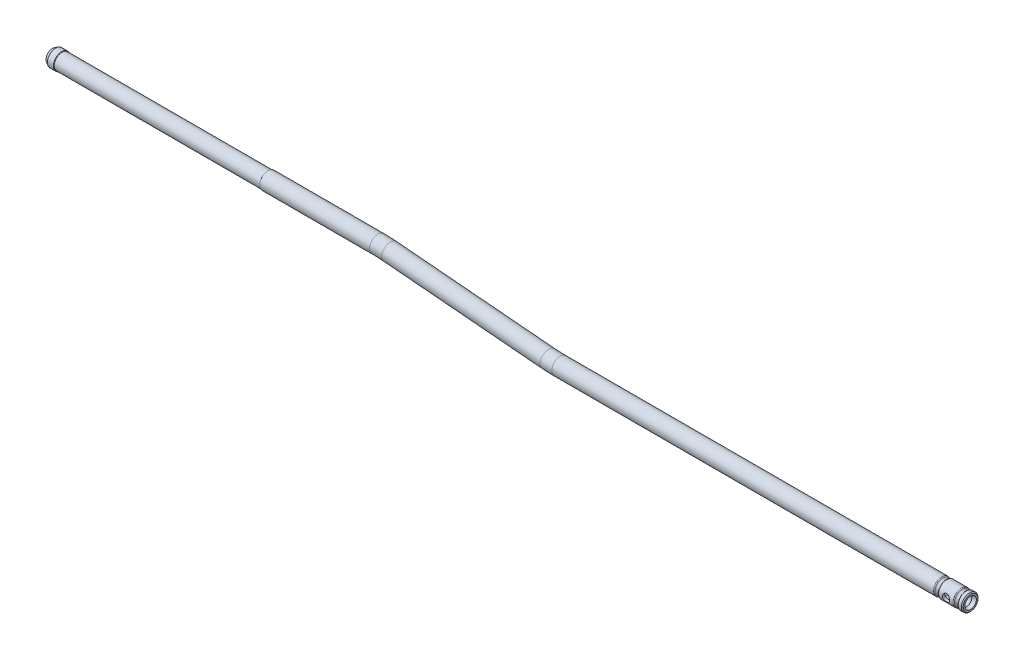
ISO-10303-21;
HEADER;
FILE_DESCRIPTION(('STEP AP214'),'2;1');
FILE_NAME('part.step','',(''),(''),'','','');
FILE_SCHEMA(('AUTOMOTIVE_DESIGN { 1 0 10303 214 1 1 1 1 }'));
ENDSEC;
DATA;
#1=APPLICATION_CONTEXT('core data for automotive mechanical design processes');
#2=APPLICATION_PROTOCOL_DEFINITION('international standard','automotive_design',2000,#1);
#3=PRODUCT_CONTEXT('',#1,'mechanical');
#4=PRODUCT('Part','Part','',(#3));
#5=PRODUCT_RELATED_PRODUCT_CATEGORY('part','',(#4));
#6=PRODUCT_DEFINITION_FORMATION('','',#4);
#7=PRODUCT_DEFINITION_CONTEXT('part definition',#1,'design');
#8=PRODUCT_DEFINITION('design','',#6,#7);
#9=PRODUCT_DEFINITION_SHAPE('','',#8);
#10=(LENGTH_UNIT() NAMED_UNIT(*) SI_UNIT(.MILLI.,.METRE.));
#11=(NAMED_UNIT(*) PLANE_ANGLE_UNIT() SI_UNIT($,.RADIAN.));
#12=(NAMED_UNIT(*) SI_UNIT($,.STERADIAN.) SOLID_ANGLE_UNIT());
#13=UNCERTAINTY_MEASURE_WITH_UNIT(LENGTH_MEASURE(1.E-05),#10,'distance_accuracy_value','');
#14=(GEOMETRIC_REPRESENTATION_CONTEXT(3) GLOBAL_UNCERTAINTY_ASSIGNED_CONTEXT((#13)) GLOBAL_UNIT_ASSIGNED_CONTEXT((#10,
#11,#12)) REPRESENTATION_CONTEXT('',''));
#15=CARTESIAN_POINT('',(0.,0.,0.));
#16=DIRECTION('',(0.,0.,1.));
#17=DIRECTION('',(1.,0.,0.));
#18=AXIS2_PLACEMENT_3D('',#15,#16,#17);
#19=CARTESIAN_POINT('',(0.,0.,0.));
#20=DIRECTION('',(1.,0.,0.));
#21=DIRECTION('',(0.,1.,0.));
#22=AXIS2_PLACEMENT_3D('',#19,#20,#21);
#23=CYLINDRICAL_SURFACE('',#22,1.5875);
#24=CARTESIAN_POINT('',(-9.65196838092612,0.,0.));
#25=DIRECTION('',(1.,0.,0.));
#26=DIRECTION('',(0.,1.,0.));
#27=AXIS2_PLACEMENT_3D('',#24,#25,#26);
#28=CIRCLE('',#27,1.5875);
#29=CARTESIAN_POINT('',(-9.65196838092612,1.5875,0.));
#30=VERTEX_POINT('',#29);
#31=EDGE_CURVE('E238',#30,#30,#28,.T.);
#32=ORIENTED_EDGE('',*,*,#31,.F.);
#33=EDGE_LOOP('',(#32));
#34=FACE_BOUND('',#33,.T.);
#35=CARTESIAN_POINT('',(-7.80030838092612,0.,0.));
#36=DIRECTION('',(1.,0.,0.));
#37=DIRECTION('',(0.,1.,0.));
#38=AXIS2_PLACEMENT_3D('',#35,#36,#37);
#39=CIRCLE('',#38,1.5875);
#40=CARTESIAN_POINT('',(-7.80030838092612,1.5875,0.));
#41=VERTEX_POINT('',#40);
#42=EDGE_CURVE('E74',#41,#41,#39,.T.);
#43=ORIENTED_EDGE('',*,*,#42,.T.);
#44=EDGE_LOOP('',(#43));
#45=FACE_BOUND('',#44,.T.);
#46=ADVANCED_FACE('F36',(#34,#45),#23,.F.);
#47=CARTESIAN_POINT('',(-7.1882,0.,0.));
#48=DIRECTION('',(1.,0.,0.));
#49=DIRECTION('',(0.,1.,0.));
#50=AXIS2_PLACEMENT_3D('',#47,#48,#49);
#51=TOROIDAL_SURFACE('',#50,2.0828,0.787400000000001);
#52=CARTESIAN_POINT('',(-6.57609161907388,0.,0.));
#53=DIRECTION('',(1.,0.,0.));
#54=DIRECTION('',(0.,1.,0.));
#55=AXIS2_PLACEMENT_3D('',#52,#53,#54);
#56=CIRCLE('',#55,1.5875);
#57=CARTESIAN_POINT('',(-6.57609161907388,1.5875,0.));
#58=VERTEX_POINT('',#57);
#59=EDGE_CURVE('E191',#58,#58,#56,.T.);
#60=ORIENTED_EDGE('',*,*,#59,.T.);
#61=EDGE_LOOP('',(#60));
#62=FACE_BOUND('',#61,.T.);
#63=ORIENTED_EDGE('',*,*,#42,.F.);
#64=EDGE_LOOP('',(#63));
#65=FACE_BOUND('',#64,.T.);
#66=ADVANCED_FACE('F178',(#62,#65),#51,.T.);
#67=CARTESIAN_POINT('',(0.,0.,0.));
#68=DIRECTION('',(1.,0.,0.));
#69=DIRECTION('',(0.,1.,0.));
#70=AXIS2_PLACEMENT_3D('',#67,#68,#69);
#71=CYLINDRICAL_SURFACE('',#70,1.5875);
#72=CARTESIAN_POINT('',(-3.5052,0.,-1.5875));
#73=CARTESIAN_POINT('',(-3.50520343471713,-0.0503445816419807,-1.58749680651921));
#74=CARTESIAN_POINT('',(-3.50906392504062,-0.100749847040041,-1.58508007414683));
#75=CARTESIAN_POINT('',(-3.52429871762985,-0.200015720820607,-1.5756421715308));
#76=CARTESIAN_POINT('',(-3.53568751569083,-0.248873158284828,-1.5686121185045));
#77=CARTESIAN_POINT('',(-3.56531654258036,-0.343410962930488,-1.5506545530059));
#78=CARTESIAN_POINT('',(-3.58352285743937,-0.389105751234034,-1.53974634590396));
#79=CARTESIAN_POINT('',(-3.62604235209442,-0.476634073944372,-1.51494178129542));
#80=CARTESIAN_POINT('',(-3.65035482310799,-0.518468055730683,-1.50104577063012));
#81=CARTESIAN_POINT('',(-3.70653599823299,-0.600859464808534,-1.47010589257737));
#82=CARTESIAN_POINT('',(-3.7388526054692,-0.641049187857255,-1.45289938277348));
#83=CARTESIAN_POINT('',(-3.80909676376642,-0.71579505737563,-1.41757073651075));
#84=CARTESIAN_POINT('',(-3.84703184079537,-0.750343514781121,-1.39944739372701));
#85=CARTESIAN_POINT('',(-3.93343165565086,-0.817569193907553,-1.36140351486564));
#86=CARTESIAN_POINT('',(-3.9826265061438,-0.849365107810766,-1.34157039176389));
#87=CARTESIAN_POINT('',(-4.08682230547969,-0.904142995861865,-1.3052832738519));
#88=CARTESIAN_POINT('',(-4.14181325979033,-0.927139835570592,-1.28882360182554));
#89=CARTESIAN_POINT('',(-4.24159219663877,-0.958461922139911,-1.26561627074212));
#90=CARTESIAN_POINT('',(-4.28534169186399,-0.969043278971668,-1.25745784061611));
#91=CARTESIAN_POINT('',(-4.37444278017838,-0.984172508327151,-1.24565483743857));
#92=CARTESIAN_POINT('',(-4.41979202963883,-0.988728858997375,-1.24200392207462));
#93=CARTESIAN_POINT('',(-4.51093339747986,-0.991535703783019,-1.23976505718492));
#94=CARTESIAN_POINT('',(-4.55672635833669,-0.989769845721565,-1.24119023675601));
#95=CARTESIAN_POINT('',(-4.64723848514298,-0.980015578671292,-1.24890421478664));
#96=CARTESIAN_POINT('',(-4.69195676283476,-0.972022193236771,-1.25519690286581));
#97=CARTESIAN_POINT('',(-4.77818342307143,-0.950516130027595,-1.27155430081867));
#98=CARTESIAN_POINT('',(-4.81974128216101,-0.937131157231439,-1.2815313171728));
#99=CARTESIAN_POINT('',(-4.90010832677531,-0.905368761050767,-1.30416376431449));
#100=CARTESIAN_POINT('',(-4.93891653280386,-0.886989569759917,-1.31682014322));
#101=CARTESIAN_POINT('',(-5.02037218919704,-0.841823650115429,-1.34623266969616));
#102=CARTESIAN_POINT('',(-5.06238743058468,-0.814108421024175,-1.36331330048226));
#103=CARTESIAN_POINT('',(-5.14163032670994,-0.752798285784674,-1.39810452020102));
#104=CARTESIAN_POINT('',(-5.17885300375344,-0.719197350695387,-1.41581574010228));
#105=CARTESIAN_POINT('',(-5.25367425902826,-0.640563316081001,-1.45328144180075));
#106=CARTESIAN_POINT('',(-5.29033448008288,-0.594559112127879,-1.47289501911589));
#107=CARTESIAN_POINT('',(-5.35536746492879,-0.495899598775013,-1.50897097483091));
#108=CARTESIAN_POINT('',(-5.38374354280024,-0.443246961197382,-1.52543461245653));
#109=CARTESIAN_POINT('',(-5.42957595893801,-0.335535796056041,-1.55257324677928));
#110=CARTESIAN_POINT('',(-5.44754327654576,-0.280764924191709,-1.56351489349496));
#111=CARTESIAN_POINT('',(-5.47372866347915,-0.168144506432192,-1.57958952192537));
#112=CARTESIAN_POINT('',(-5.48196044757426,-0.110299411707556,-1.58473067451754));
#113=CARTESIAN_POINT('',(-5.4876440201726,-0.00250131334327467,-1.58827612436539));
#114=CARTESIAN_POINT('',(-5.48651008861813,0.0473536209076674,-1.5875643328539));
#115=CARTESIAN_POINT('',(-5.47682740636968,0.146049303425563,-1.58153969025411));
#116=CARTESIAN_POINT('',(-5.46827914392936,0.194890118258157,-1.57622714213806));
#117=CARTESIAN_POINT('',(-5.44469289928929,0.288313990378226,-1.56178845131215));
#118=CARTESIAN_POINT('',(-5.42991729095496,0.332988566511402,-1.55281691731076));
#119=CARTESIAN_POINT('',(-5.39454825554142,0.419179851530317,-1.53180099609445));
#120=CARTESIAN_POINT('',(-5.37395384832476,0.460696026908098,-1.51975609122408));
#121=CARTESIAN_POINT('',(-5.32523643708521,0.543948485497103,-1.49210914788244));
#122=CARTESIAN_POINT('',(-5.29656278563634,0.585282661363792,-1.47627059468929));
#123=CARTESIAN_POINT('',(-5.23365131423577,0.662843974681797,-1.44311374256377));
#124=CARTESIAN_POINT('',(-5.19940729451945,0.69906533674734,-1.42579380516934));
#125=CARTESIAN_POINT('',(-5.12061003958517,0.770803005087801,-1.38848071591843));
#126=CARTESIAN_POINT('',(-5.07528210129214,0.805459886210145,-1.36846318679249));
#127=CARTESIAN_POINT('',(-4.97873644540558,0.86679017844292,-1.330463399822));
#128=CARTESIAN_POINT('',(-4.9275229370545,0.893469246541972,-1.31247970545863));
#129=CARTESIAN_POINT('',(-4.83130795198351,0.93318349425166,-1.28444073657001));
#130=CARTESIAN_POINT('',(-4.7872614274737,0.947907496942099,-1.27351355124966));
#131=CARTESIAN_POINT('',(-4.69676334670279,0.971121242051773,-1.25590410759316));
#132=CARTESIAN_POINT('',(-4.65031565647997,0.979620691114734,-1.24921524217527));
#133=CARTESIAN_POINT('',(-4.55593859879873,0.989916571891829,-1.24107550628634));
#134=CARTESIAN_POINT('',(-4.50800239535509,0.991675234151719,-1.23965415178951));
#135=CARTESIAN_POINT('',(-4.41253037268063,0.988249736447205,-1.24238575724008));
#136=CARTESIAN_POINT('',(-4.3649946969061,0.983063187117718,-1.24654063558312));
#137=CARTESIAN_POINT('',(-4.27554846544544,0.966789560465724,-1.25919295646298));
#138=CARTESIAN_POINT('',(-4.23349039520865,0.95620170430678,-1.2673208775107));
#139=CARTESIAN_POINT('',(-4.15177284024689,0.929934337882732,-1.28671824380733));
#140=CARTESIAN_POINT('',(-4.11211435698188,0.914252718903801,-1.29798898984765));
#141=CARTESIAN_POINT('',(-4.03010240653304,0.875646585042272,-1.32439446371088));
#142=CARTESIAN_POINT('',(-3.98819450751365,0.852000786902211,-1.33985267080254));
#143=CARTESIAN_POINT('',(-3.90853362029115,0.799183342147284,-1.37201310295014));
#144=CARTESIAN_POINT('',(-3.87078404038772,0.770007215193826,-1.38871632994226));
#145=CARTESIAN_POINT('',(-3.79283454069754,0.700266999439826,-1.42534972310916));
#146=CARTESIAN_POINT('',(-3.75361394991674,0.658591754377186,-1.44526816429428));
#147=CARTESIAN_POINT('',(-3.68252756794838,0.568478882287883,-1.48302872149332));
#148=CARTESIAN_POINT('',(-3.65066624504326,0.52003717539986,-1.50086957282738));
#149=CARTESIAN_POINT('',(-3.59548363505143,0.41727670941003,-1.53262143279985));
#150=CARTESIAN_POINT('',(-3.57216436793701,0.362956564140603,-1.5465315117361));
#151=CARTESIAN_POINT('',(-3.53546442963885,0.250073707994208,-1.56872434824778));
#152=CARTESIAN_POINT('',(-3.52204850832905,0.191526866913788,-1.57702705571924));
#153=CARTESIAN_POINT('',(-3.51110388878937,0.110236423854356,-1.58382172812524));
#154=CARTESIAN_POINT('',(-3.50889380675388,0.0882749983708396,-1.58519733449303));
#155=CARTESIAN_POINT('',(-3.50594106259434,0.0442129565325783,-1.5870371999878));
#156=CARTESIAN_POINT('',(-3.5051984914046,0.0221123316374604,-1.58750140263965));
#157=CARTESIAN_POINT('',(-3.5052,0.,-1.5875));
#158=B_SPLINE_CURVE_WITH_KNOTS('',3,(#72,#73,#74,#75,#76,#77,#78,#79,#80,#81,#82,#83,#84,#85,
#86,#87,#88,#89,#90,#91,#92,#93,#94,#95,#96,#97,#98,#99,#100,#101,#102,#103,#104,#105,#106,#107,
#108,#109,#110,#111,#112,#113,#114,#115,#116,#117,#118,#119,#120,#121,#122,#123,#124,#125,#126,
#127,#128,#129,#130,#131,#132,#133,#134,#135,#136,#137,#138,#139,#140,#141,#142,#143,#144,#145,
#146,#147,#148,#149,#150,#151,#152,#153,#154,#155,#156,#157),.UNSPECIFIED.,.T.,.F.,(4,2,2,2,2,2,
2,2,2,2,2,2,2,2,2,2,2,2,2,2,2,2,2,2,2,2,2,2,2,2,2,2,2,2,2,2,2,2,2,2,2,2,4),(0.,0.15094083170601,
0.302173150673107,0.452662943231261,0.603135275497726,0.765604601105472,0.928293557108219,
1.11293165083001,1.29725641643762,1.43391972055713,1.57039051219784,1.70721453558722,
1.84414800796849,1.97801272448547,2.11192488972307,2.27079140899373,2.42982162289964,
2.61491751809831,2.79993926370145,2.9748740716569,3.14956214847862,3.29841419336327,
3.44725643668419,3.59037139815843,3.73351048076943,3.891121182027,4.0489085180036,
4.22951353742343,4.40999018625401,4.55255537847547,4.69489777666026,4.83803658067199,
4.9812246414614,5.11308571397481,5.24500144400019,5.39608267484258,5.54728682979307,
5.72824193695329,5.90930662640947,6.09041410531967,6.27087379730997,6.33716587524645,
6.403462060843),.UNSPECIFIED.);
#159=CARTESIAN_POINT('',(-3.5052,0.,-1.5875));
#160=VERTEX_POINT('',#159);
#161=EDGE_CURVE('E166',#160,#160,#158,.T.);
#162=ORIENTED_EDGE('',*,*,#161,.T.);
#163=EDGE_LOOP('',(#162));
#164=FACE_BOUND('',#163,.T.);
#165=CARTESIAN_POINT('',(-3.5052,0.,1.5875));
#166=CARTESIAN_POINT('',(-3.50520343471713,0.0503445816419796,1.58749680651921));
#167=CARTESIAN_POINT('',(-3.50906392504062,0.10074984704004,1.58508007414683));
#168=CARTESIAN_POINT('',(-3.52429871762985,0.200015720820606,1.5756421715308));
#169=CARTESIAN_POINT('',(-3.53568751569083,0.248873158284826,1.5686121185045));
#170=CARTESIAN_POINT('',(-3.56531654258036,0.343410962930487,1.5506545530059));
#171=CARTESIAN_POINT('',(-3.58352285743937,0.389105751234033,1.53974634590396));
#172=CARTESIAN_POINT('',(-3.62604235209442,0.476634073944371,1.51494178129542));
#173=CARTESIAN_POINT('',(-3.65035482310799,0.518468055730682,1.50104577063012));
#174=CARTESIAN_POINT('',(-3.70653599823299,0.600859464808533,1.47010589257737));
#175=CARTESIAN_POINT('',(-3.7388526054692,0.641049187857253,1.45289938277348));
#176=CARTESIAN_POINT('',(-3.80909676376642,0.715795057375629,1.41757073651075));
#177=CARTESIAN_POINT('',(-3.84703184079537,0.75034351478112,1.39944739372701));
#178=CARTESIAN_POINT('',(-3.93343165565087,0.817569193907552,1.36140351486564));
#179=CARTESIAN_POINT('',(-3.9826265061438,0.849365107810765,1.34157039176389));
#180=CARTESIAN_POINT('',(-4.08682230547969,0.904142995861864,1.3052832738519));
#181=CARTESIAN_POINT('',(-4.14181325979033,0.927139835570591,1.28882360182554));
#182=CARTESIAN_POINT('',(-4.24159219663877,0.95846192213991,1.26561627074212));
#183=CARTESIAN_POINT('',(-4.28534169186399,0.969043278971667,1.25745784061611));
#184=CARTESIAN_POINT('',(-4.37444278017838,0.984172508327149,1.24565483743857));
#185=CARTESIAN_POINT('',(-4.41979202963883,0.988728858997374,1.24200392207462));
#186=CARTESIAN_POINT('',(-4.51093339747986,0.991535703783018,1.23976505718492));
#187=CARTESIAN_POINT('',(-4.55672635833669,0.989769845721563,1.24119023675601));
#188=CARTESIAN_POINT('',(-4.64723848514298,0.980015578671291,1.24890421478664));
#189=CARTESIAN_POINT('',(-4.69195676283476,0.97202219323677,1.25519690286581));
#190=CARTESIAN_POINT('',(-4.77818342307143,0.950516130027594,1.27155430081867));
#191=CARTESIAN_POINT('',(-4.81974128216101,0.937131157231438,1.2815313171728));
#192=CARTESIAN_POINT('',(-4.90010832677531,0.905368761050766,1.30416376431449));
#193=CARTESIAN_POINT('',(-4.93891653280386,0.886989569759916,1.31682014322));
#194=CARTESIAN_POINT('',(-5.02037218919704,0.841823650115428,1.34623266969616));
#195=CARTESIAN_POINT('',(-5.06238743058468,0.814108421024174,1.36331330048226));
#196=CARTESIAN_POINT('',(-5.14163032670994,0.752798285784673,1.39810452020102));
#197=CARTESIAN_POINT('',(-5.17885300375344,0.719197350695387,1.41581574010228));
#198=CARTESIAN_POINT('',(-5.25367425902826,0.640563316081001,1.45328144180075));
#199=CARTESIAN_POINT('',(-5.29033448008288,0.594559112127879,1.47289501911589));
#200=CARTESIAN_POINT('',(-5.35536746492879,0.495899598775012,1.50897097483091));
#201=CARTESIAN_POINT('',(-5.38374354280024,0.443246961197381,1.52543461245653));
#202=CARTESIAN_POINT('',(-5.42957595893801,0.33553579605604,1.55257324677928));
#203=CARTESIAN_POINT('',(-5.44754327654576,0.280764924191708,1.56351489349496));
#204=CARTESIAN_POINT('',(-5.47372866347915,0.168144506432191,1.57958952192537));
#205=CARTESIAN_POINT('',(-5.48196044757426,0.110299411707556,1.58473067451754));
#206=CARTESIAN_POINT('',(-5.4876440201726,0.00250131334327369,1.58827612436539));
#207=CARTESIAN_POINT('',(-5.48651008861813,-0.0473536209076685,1.5875643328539));
#208=CARTESIAN_POINT('',(-5.47682740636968,-0.146049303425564,1.58153969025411));
#209=CARTESIAN_POINT('',(-5.46827914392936,-0.194890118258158,1.57622714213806));
#210=CARTESIAN_POINT('',(-5.44469289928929,-0.288313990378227,1.56178845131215));
#211=CARTESIAN_POINT('',(-5.42991729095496,-0.332988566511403,1.55281691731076));
#212=CARTESIAN_POINT('',(-5.39454825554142,-0.419179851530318,1.53180099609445));
#213=CARTESIAN_POINT('',(-5.37395384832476,-0.460696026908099,1.51975609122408));
#214=CARTESIAN_POINT('',(-5.32523643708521,-0.543948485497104,1.49210914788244));
#215=CARTESIAN_POINT('',(-5.29656278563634,-0.585282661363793,1.47627059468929));
#216=CARTESIAN_POINT('',(-5.23365131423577,-0.662843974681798,1.44311374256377));
#217=CARTESIAN_POINT('',(-5.19940729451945,-0.699065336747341,1.42579380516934));
#218=CARTESIAN_POINT('',(-5.12061003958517,-0.770803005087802,1.38848071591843));
#219=CARTESIAN_POINT('',(-5.07528210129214,-0.805459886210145,1.36846318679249));
#220=CARTESIAN_POINT('',(-4.97873644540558,-0.866790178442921,1.330463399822));
#221=CARTESIAN_POINT('',(-4.9275229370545,-0.893469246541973,1.31247970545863));
#222=CARTESIAN_POINT('',(-4.83130795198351,-0.933183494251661,1.28444073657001));
#223=CARTESIAN_POINT('',(-4.7872614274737,-0.9479074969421,1.27351355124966));
#224=CARTESIAN_POINT('',(-4.69676334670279,-0.971121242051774,1.25590410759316));
#225=CARTESIAN_POINT('',(-4.65031565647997,-0.979620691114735,1.24921524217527));
#226=CARTESIAN_POINT('',(-4.55593859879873,-0.98991657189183,1.24107550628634));
#227=CARTESIAN_POINT('',(-4.50800239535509,-0.99167523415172,1.23965415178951));
#228=CARTESIAN_POINT('',(-4.41253037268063,-0.988249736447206,1.24238575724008));
#229=CARTESIAN_POINT('',(-4.3649946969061,-0.983063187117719,1.24654063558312));
#230=CARTESIAN_POINT('',(-4.27554846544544,-0.966789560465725,1.25919295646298));
#231=CARTESIAN_POINT('',(-4.23349039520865,-0.956201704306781,1.2673208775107));
#232=CARTESIAN_POINT('',(-4.15177284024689,-0.929934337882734,1.28671824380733));
#233=CARTESIAN_POINT('',(-4.11211435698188,-0.914252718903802,1.29798898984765));
#234=CARTESIAN_POINT('',(-4.03010240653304,-0.875646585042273,1.32439446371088));
#235=CARTESIAN_POINT('',(-3.98819450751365,-0.852000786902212,1.33985267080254));
#236=CARTESIAN_POINT('',(-3.90853362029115,-0.799183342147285,1.37201310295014));
#237=CARTESIAN_POINT('',(-3.87078404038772,-0.770007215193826,1.38871632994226));
#238=CARTESIAN_POINT('',(-3.79283454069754,-0.700266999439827,1.42534972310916));
#239=CARTESIAN_POINT('',(-3.75361394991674,-0.658591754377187,1.44526816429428));
#240=CARTESIAN_POINT('',(-3.68252756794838,-0.568478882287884,1.48302872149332));
#241=CARTESIAN_POINT('',(-3.65066624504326,-0.52003717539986,1.50086957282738));
#242=CARTESIAN_POINT('',(-3.59548363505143,-0.417276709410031,1.53262143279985));
#243=CARTESIAN_POINT('',(-3.57216436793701,-0.362956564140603,1.5465315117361));
#244=CARTESIAN_POINT('',(-3.53546442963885,-0.250073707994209,1.56872434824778));
#245=CARTESIAN_POINT('',(-3.52204850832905,-0.191526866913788,1.57702705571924));
#246=CARTESIAN_POINT('',(-3.51110388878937,-0.110236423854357,1.58382172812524));
#247=CARTESIAN_POINT('',(-3.50889380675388,-0.0882749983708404,1.58519733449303));
#248=CARTESIAN_POINT('',(-3.50594106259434,-0.0442129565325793,1.5870371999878));
#249=CARTESIAN_POINT('',(-3.5051984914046,-0.0221123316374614,1.58750140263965));
#250=CARTESIAN_POINT('',(-3.5052,0.,1.5875));
#251=B_SPLINE_CURVE_WITH_KNOTS('',3,(#165,#166,#167,#168,#169,#170,#171,#172,#173,#174,#175,
#176,#177,#178,#179,#180,#181,#182,#183,#184,#185,#186,#187,#188,#189,#190,#191,#192,#193,#194,
#195,#196,#197,#198,#199,#200,#201,#202,#203,#204,#205,#206,#207,#208,#209,#210,#211,#212,#213,
#214,#215,#216,#217,#218,#219,#220,#221,#222,#223,#224,#225,#226,#227,#228,#229,#230,#231,#232,
#233,#234,#235,#236,#237,#238,#239,#240,#241,#242,#243,#244,#245,#246,#247,#248,#249,#250),
.UNSPECIFIED.,.T.,.F.,(4,2,2,2,2,2,2,2,2,2,2,2,2,2,2,2,2,2,2,2,2,2,2,2,2,2,2,2,2,2,2,2,2,2,2,2,
2,2,2,2,2,2,4),(0.,0.15094083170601,0.302173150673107,0.452662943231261,0.603135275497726,
0.765604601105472,0.92829355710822,1.11293165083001,1.29725641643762,1.43391972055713,
1.57039051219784,1.70721453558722,1.84414800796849,1.97801272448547,2.11192488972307,
2.27079140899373,2.42982162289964,2.61491751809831,2.79993926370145,2.9748740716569,
3.14956214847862,3.29841419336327,3.44725643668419,3.59037139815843,3.73351048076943,
3.891121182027,4.0489085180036,4.22951353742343,4.40999018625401,4.55255537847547,
4.69489777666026,4.838036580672,4.98122464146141,5.11308571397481,5.24500144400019,
5.39608267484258,5.54728682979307,5.72824193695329,5.90930662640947,6.09041410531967,
6.27087379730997,6.33716587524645,6.403462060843),.UNSPECIFIED.);
#252=CARTESIAN_POINT('',(-3.5052,0.,1.5875));
#253=VERTEX_POINT('',#252);
#254=EDGE_CURVE('E145',#253,#253,#251,.T.);
#255=ORIENTED_EDGE('',*,*,#254,.T.);
#256=EDGE_LOOP('',(#255));
#257=FACE_BOUND('',#256,.T.);
#258=ORIENTED_EDGE('',*,*,#59,.F.);
#259=EDGE_LOOP('',(#258));
#260=FACE_BOUND('',#259,.T.);
#261=CARTESIAN_POINT('',(-2.41550838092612,0.,0.));
#262=DIRECTION('',(1.,0.,0.));
#263=DIRECTION('',(0.,1.,0.));
#264=AXIS2_PLACEMENT_3D('',#261,#262,#263);
#265=CIRCLE('',#264,1.5875);
#266=CARTESIAN_POINT('',(-2.41550838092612,1.5875,0.));
#267=VERTEX_POINT('',#266);
#268=EDGE_CURVE('E195',#267,#267,#265,.T.);
#269=ORIENTED_EDGE('',*,*,#268,.T.);
#270=EDGE_LOOP('',(#269));
#271=FACE_BOUND('',#270,.T.);
#272=ADVANCED_FACE('F173',(#164,#257,#260,#271),#71,.F.);
#273=CARTESIAN_POINT('',(-1.8034,0.,0.));
#274=DIRECTION('',(1.,0.,0.));
#275=DIRECTION('',(0.,1.,0.));
#276=AXIS2_PLACEMENT_3D('',#273,#274,#275);
#277=TOROIDAL_SURFACE('',#276,2.0828,0.7874);
#278=ORIENTED_EDGE('',*,*,#268,.F.);
#279=EDGE_LOOP('',(#278));
#280=FACE_BOUND('',#279,.T.);
#281=CARTESIAN_POINT('',(-1.19129161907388,0.,0.));
#282=DIRECTION('',(1.,0.,0.));
#283=DIRECTION('',(0.,1.,0.));
#284=AXIS2_PLACEMENT_3D('',#281,#282,#283);
#285=CIRCLE('',#284,1.5875);
#286=CARTESIAN_POINT('',(-1.19129161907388,1.5875,0.));
#287=VERTEX_POINT('',#286);
#288=EDGE_CURVE('E200',#287,#287,#285,.T.);
#289=ORIENTED_EDGE('',*,*,#288,.T.);
#290=EDGE_LOOP('',(#289));
#291=FACE_BOUND('',#290,.T.);
#292=ADVANCED_FACE('F177',(#280,#291),#277,.T.);
#293=CARTESIAN_POINT('',(0.,0.,0.));
#294=DIRECTION('',(1.,0.,0.));
#295=DIRECTION('',(0.,1.,0.));
#296=AXIS2_PLACEMENT_3D('',#293,#294,#295);
#297=CYLINDRICAL_SURFACE('',#296,1.5875);
#298=ORIENTED_EDGE('',*,*,#288,.F.);
#299=EDGE_LOOP('',(#298));
#300=FACE_BOUND('',#299,.T.);
#301=CARTESIAN_POINT('',(0.,0.,0.));
#302=DIRECTION('',(1.,0.,0.));
#303=DIRECTION('',(0.,1.,0.));
#304=AXIS2_PLACEMENT_3D('',#301,#302,#303);
#305=CIRCLE('',#304,1.5875);
#306=CARTESIAN_POINT('',(0.,1.5875,0.));
#307=VERTEX_POINT('',#306);
#308=EDGE_CURVE('E203',#307,#307,#305,.T.);
#309=ORIENTED_EDGE('',*,*,#308,.T.);
#310=EDGE_LOOP('',(#309));
#311=FACE_BOUND('',#310,.T.);
#312=ADVANCED_FACE('F253',(#300,#311),#297,.F.);
#313=CARTESIAN_POINT('',(0.,-11.505543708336,0.));
#314=DIRECTION('',(1.,0.,0.));
#315=DIRECTION('',(0.,1.,0.));
#316=AXIS2_PLACEMENT_3D('',#313,#314,#315);
#317=PLANE('',#316);
#318=CARTESIAN_POINT('',(0.,0.,0.));
#319=DIRECTION('',(1.,0.,0.));
#320=DIRECTION('',(0.,1.,0.));
#321=AXIS2_PLACEMENT_3D('',#318,#319,#320);
#322=CIRCLE('',#321,2.032);
#323=CARTESIAN_POINT('',(0.,2.032,0.));
#324=VERTEX_POINT('',#323);
#325=EDGE_CURVE('E206',#324,#324,#322,.T.);
#326=ORIENTED_EDGE('',*,*,#325,.T.);
#327=EDGE_LOOP('',(#326));
#328=FACE_BOUND('',#327,.T.);
#329=ORIENTED_EDGE('',*,*,#308,.F.);
#330=EDGE_LOOP('',(#329));
#331=FACE_BOUND('',#330,.T.);
#332=ADVANCED_FACE('F258',(#328,#331),#317,.T.);
#333=CARTESIAN_POINT('',(0.,0.,0.));
#334=DIRECTION('',(-1.,0.,0.));
#335=DIRECTION('',(0.,-1.,0.));
#336=AXIS2_PLACEMENT_3D('',#333,#334,#335);
#337=CONICAL_SURFACE('',#336,2.032,0.785398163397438);
#338=CARTESIAN_POINT('',(-0.254,0.,0.));
#339=DIRECTION('',(1.,0.,0.));
#340=DIRECTION('',(0.,1.,0.));
#341=AXIS2_PLACEMENT_3D('',#338,#339,#340);
#342=CIRCLE('',#341,2.286);
#343=CARTESIAN_POINT('',(-0.254,2.286,0.));
#344=VERTEX_POINT('',#343);
#345=EDGE_CURVE('E209',#344,#344,#342,.T.);
#346=ORIENTED_EDGE('',*,*,#345,.T.);
#347=EDGE_LOOP('',(#346));
#348=FACE_BOUND('',#347,.T.);
#349=ORIENTED_EDGE('',*,*,#325,.F.);
#350=EDGE_LOOP('',(#349));
#351=FACE_BOUND('',#350,.T.);
#352=ADVANCED_FACE('F262',(#348,#351),#337,.T.);
#353=CARTESIAN_POINT('',(0.,0.,0.));
#354=DIRECTION('',(1.,0.,0.));
#355=DIRECTION('',(0.,1.,0.));
#356=AXIS2_PLACEMENT_3D('',#353,#354,#355);
#357=CYLINDRICAL_SURFACE('',#356,2.286);
#358=CARTESIAN_POINT('',(-1.08497951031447,0.,0.));
#359=DIRECTION('',(1.,0.,0.));
#360=DIRECTION('',(0.,1.,0.));
#361=AXIS2_PLACEMENT_3D('',#358,#359,#360);
#362=CIRCLE('',#361,2.286);
#363=CARTESIAN_POINT('',(-1.08497951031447,2.286,0.));
#364=VERTEX_POINT('',#363);
#365=EDGE_CURVE('E212',#364,#364,#362,.T.);
#366=ORIENTED_EDGE('',*,*,#365,.T.);
#367=EDGE_LOOP('',(#366));
#368=FACE_BOUND('',#367,.T.);
#369=ORIENTED_EDGE('',*,*,#345,.F.);
#370=EDGE_LOOP('',(#369));
#371=FACE_BOUND('',#370,.T.);
#372=ADVANCED_FACE('F268',(#368,#371),#357,.T.);
#373=CARTESIAN_POINT('',(-1.08497951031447,0.,0.));
#374=DIRECTION('',(1.,0.,0.));
#375=DIRECTION('',(0.,1.,0.));
#376=AXIS2_PLACEMENT_3D('',#373,#374,#375);
#377=TOROIDAL_SURFACE('',#376,2.032,0.254);
#378=CARTESIAN_POINT('',(-1.32445300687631,0.,0.));
#379=DIRECTION('',(1.,0.,0.));
#380=DIRECTION('',(0.,1.,0.));
#381=AXIS2_PLACEMENT_3D('',#378,#379,#380);
#382=CIRCLE('',#381,2.11666666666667);
#383=CARTESIAN_POINT('',(-1.32445300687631,2.11666666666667,0.));
#384=VERTEX_POINT('',#383);
#385=EDGE_CURVE('E215',#384,#384,#382,.T.);
#386=ORIENTED_EDGE('',*,*,#385,.T.);
#387=EDGE_LOOP('',(#386));
#388=FACE_BOUND('',#387,.T.);
#389=ORIENTED_EDGE('',*,*,#365,.F.);
#390=EDGE_LOOP('',(#389));
#391=FACE_BOUND('',#390,.T.);
#392=ADVANCED_FACE('F274',(#388,#391),#377,.T.);
#393=CARTESIAN_POINT('',(-1.8034,0.,0.));
#394=DIRECTION('',(1.,0.,0.));
#395=DIRECTION('',(0.,1.,0.));
#396=AXIS2_PLACEMENT_3D('',#393,#394,#395);
#397=TOROIDAL_SURFACE('',#396,2.286,0.508);
#398=CARTESIAN_POINT('',(-2.28234699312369,0.,0.));
#399=DIRECTION('',(1.,0.,0.));
#400=DIRECTION('',(0.,1.,0.));
#401=AXIS2_PLACEMENT_3D('',#398,#399,#400);
#402=CIRCLE('',#401,2.11666666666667);
#403=CARTESIAN_POINT('',(-2.28234699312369,2.11666666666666,0.));
#404=VERTEX_POINT('',#403);
#405=EDGE_CURVE('E218',#404,#404,#402,.T.);
#406=ORIENTED_EDGE('',*,*,#405,.T.);
#407=EDGE_LOOP('',(#406));
#408=FACE_BOUND('',#407,.T.);
#409=ORIENTED_EDGE('',*,*,#385,.F.);
#410=EDGE_LOOP('',(#409));
#411=FACE_BOUND('',#410,.T.);
#412=ADVANCED_FACE('F277',(#408,#411),#397,.F.);
#413=CARTESIAN_POINT('',(-2.52182048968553,0.,0.));
#414=DIRECTION('',(1.,0.,0.));
#415=DIRECTION('',(0.,1.,0.));
#416=AXIS2_PLACEMENT_3D('',#413,#414,#415);
#417=TOROIDAL_SURFACE('',#416,2.032,0.254);
#418=CARTESIAN_POINT('',(-2.52182048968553,0.,0.));
#419=DIRECTION('',(1.,0.,0.));
#420=DIRECTION('',(0.,1.,0.));
#421=AXIS2_PLACEMENT_3D('',#418,#419,#420);
#422=CIRCLE('',#421,2.286);
#423=CARTESIAN_POINT('',(-2.52182048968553,2.286,0.));
#424=VERTEX_POINT('',#423);
#425=EDGE_CURVE('E221',#424,#424,#422,.T.);
#426=ORIENTED_EDGE('',*,*,#425,.T.);
#427=EDGE_LOOP('',(#426));
#428=FACE_BOUND('',#427,.T.);
#429=ORIENTED_EDGE('',*,*,#405,.F.);
#430=EDGE_LOOP('',(#429));
#431=FACE_BOUND('',#430,.T.);
#432=ADVANCED_FACE('F129',(#428,#431),#417,.T.);
#433=CARTESIAN_POINT('',(0.,0.,0.));
#434=DIRECTION('',(1.,0.,0.));
#435=DIRECTION('',(0.,1.,0.));
#436=AXIS2_PLACEMENT_3D('',#433,#434,#435);
#437=CYLINDRICAL_SURFACE('',#436,2.286);
#438=CARTESIAN_POINT('',(-3.5052,0.,-2.286));
#439=CARTESIAN_POINT('',(-3.5052061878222,-0.0528796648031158,-2.28599527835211));
#440=CARTESIAN_POINT('',(-3.50945895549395,-0.105832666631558,-2.28414429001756));
#441=CARTESIAN_POINT('',(-3.52631431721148,-0.210229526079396,-2.27691795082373));
#442=CARTESIAN_POINT('',(-3.5389376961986,-0.261669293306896,-2.27153382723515));
#443=CARTESIAN_POINT('',(-3.57197254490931,-0.361355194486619,-2.25781761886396));
#444=CARTESIAN_POINT('',(-3.59235677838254,-0.409611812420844,-2.24949585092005));
#445=CARTESIAN_POINT('',(-3.64021755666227,-0.501970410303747,-2.23070524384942));
#446=CARTESIAN_POINT('',(-3.66769227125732,-0.546073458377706,-2.2202369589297));
#447=CARTESIAN_POINT('',(-3.73050002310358,-0.631301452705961,-2.19756529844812));
#448=CARTESIAN_POINT('',(-3.76615125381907,-0.672175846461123,-2.18530216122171));
#449=CARTESIAN_POINT('',(-3.8436257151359,-0.747584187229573,-2.16066901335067));
#450=CARTESIAN_POINT('',(-3.88545242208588,-0.78211453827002,-2.14829894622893));
#451=CARTESIAN_POINT('',(-3.97683430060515,-0.845710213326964,-2.12409780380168));
#452=CARTESIAN_POINT('',(-4.02668553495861,-0.874377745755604,-2.11233231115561));
#453=CARTESIAN_POINT('',(-4.13108361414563,-0.922808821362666,-2.0916306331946));
#454=CARTESIAN_POINT('',(-4.1856278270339,-0.942577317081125,-2.08269287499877));
#455=CARTESIAN_POINT('',(-4.29498011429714,-0.971593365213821,-2.06931085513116));
#456=CARTESIAN_POINT('',(-4.34963355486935,-0.981325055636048,-2.06466109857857));
#457=CARTESIAN_POINT('',(-4.45998007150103,-0.991498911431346,-2.05979639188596));
#458=CARTESIAN_POINT('',(-4.51567248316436,-0.991946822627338,-2.05957869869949));
#459=CARTESIAN_POINT('',(-4.62150364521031,-0.98390289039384,-2.06343026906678));
#460=CARTESIAN_POINT('',(-4.67171516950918,-0.976160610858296,-2.06714010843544));
#461=CARTESIAN_POINT('',(-4.77003989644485,-0.953221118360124,-2.07781708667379));
#462=CARTESIAN_POINT('',(-4.81815265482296,-0.93802233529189,-2.08478491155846));
#463=CARTESIAN_POINT('',(-4.9121774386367,-0.900300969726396,-2.10135310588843));
#464=CARTESIAN_POINT('',(-4.95801764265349,-0.877624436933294,-2.11100808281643));
#465=CARTESIAN_POINT('',(-5.0454298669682,-0.825701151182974,-2.13185250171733));
#466=CARTESIAN_POINT('',(-5.08700012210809,-0.796451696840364,-2.14304257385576));
#467=CARTESIAN_POINT('',(-5.16872331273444,-0.729053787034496,-2.16694889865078));
#468=CARTESIAN_POINT('',(-5.20839293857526,-0.6903337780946,-2.17971078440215));
#469=CARTESIAN_POINT('',(-5.28084551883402,-0.606675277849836,-2.20445977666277));
#470=CARTESIAN_POINT('',(-5.31362658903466,-0.561735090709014,-2.21644667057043));
#471=CARTESIAN_POINT('',(-5.37216075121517,-0.465340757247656,-2.23869650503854));
#472=CARTESIAN_POINT('',(-5.39770184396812,-0.413744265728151,-2.24890460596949));
#473=CARTESIAN_POINT('',(-5.43956901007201,-0.306431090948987,-2.26601859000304));
#474=CARTESIAN_POINT('',(-5.45590060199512,-0.25071689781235,-2.27292645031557));
#475=CARTESIAN_POINT('',(-5.47783799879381,-0.14077538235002,-2.2822829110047));
#476=CARTESIAN_POINT('',(-5.48409145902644,-0.086700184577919,-2.28500024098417));
#477=CARTESIAN_POINT('',(-5.48764497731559,0.0217915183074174,-2.28653898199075));
#478=CARTESIAN_POINT('',(-5.48494787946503,0.0762079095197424,-2.28536163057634));
#479=CARTESIAN_POINT('',(-5.47112638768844,0.180702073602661,-2.27941539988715));
#480=CARTESIAN_POINT('',(-5.46047028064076,0.230854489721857,-2.27484617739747));
#481=CARTESIAN_POINT('',(-5.43170020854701,0.328596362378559,-2.26279624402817));
#482=CARTESIAN_POINT('',(-5.41358532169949,0.376185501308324,-2.25531517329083));
#483=CARTESIAN_POINT('',(-5.36982661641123,0.469134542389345,-2.23785967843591));
#484=CARTESIAN_POINT('',(-5.34396521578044,0.514378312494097,-2.22781464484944));
#485=CARTESIAN_POINT('',(-5.28568517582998,0.60004726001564,-2.20628499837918));
#486=CARTESIAN_POINT('',(-5.25326371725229,0.640470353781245,-2.19479976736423));
#487=CARTESIAN_POINT('',(-5.17987251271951,0.718625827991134,-2.17052391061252));
#488=CARTESIAN_POINT('',(-5.13843696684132,0.755911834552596,-2.15770084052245));
#489=CARTESIAN_POINT('',(-5.04971882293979,0.823140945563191,-2.13296068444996));
#490=CARTESIAN_POINT('',(-5.00243447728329,0.853081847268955,-2.12104387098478));
#491=CARTESIAN_POINT('',(-4.90208322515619,0.905251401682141,-2.09931732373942));
#492=CARTESIAN_POINT('',(-4.8489213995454,0.927317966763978,-2.08955330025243));
#493=CARTESIAN_POINT('',(-4.73907682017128,0.961984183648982,-2.07382530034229));
#494=CARTESIAN_POINT('',(-4.68239734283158,0.974592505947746,-2.06785784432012));
#495=CARTESIAN_POINT('',(-4.57211788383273,0.989090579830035,-2.06095957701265));
#496=CARTESIAN_POINT('',(-4.51864499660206,0.991772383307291,-2.05965686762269));
#497=CARTESIAN_POINT('',(-4.41203391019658,0.988490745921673,-2.06123404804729));
#498=CARTESIAN_POINT('',(-4.35889565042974,0.982528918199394,-2.06411315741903));
#499=CARTESIAN_POINT('',(-4.2574568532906,0.962811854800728,-2.07337813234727));
#500=CARTESIAN_POINT('',(-4.209050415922,0.949498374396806,-2.07956464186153));
#501=CARTESIAN_POINT('',(-4.11515696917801,0.915907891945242,-2.09457520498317));
#502=CARTESIAN_POINT('',(-4.06967079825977,0.895628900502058,-2.10340001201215));
#503=CARTESIAN_POINT('',(-3.97979260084,0.847225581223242,-2.12337707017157));
#504=CARTESIAN_POINT('',(-3.9356476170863,0.818689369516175,-2.13464049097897));
#505=CARTESIAN_POINT('',(-3.85252585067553,0.755133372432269,-2.15794217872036));
#506=CARTESIAN_POINT('',(-3.81355109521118,0.720111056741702,-2.16998074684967));
#507=CARTESIAN_POINT('',(-3.73860323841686,0.641199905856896,-2.1946528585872));
#508=CARTESIAN_POINT('',(-3.70313292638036,0.596821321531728,-2.20725503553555));
#509=CARTESIAN_POINT('',(-3.64010108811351,0.502288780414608,-2.23066575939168));
#510=CARTESIAN_POINT('',(-3.6125431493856,0.452132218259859,-2.24147349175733));
#511=CARTESIAN_POINT('',(-3.5666427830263,0.348061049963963,-2.25995686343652));
#512=CARTESIAN_POINT('',(-3.54817948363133,0.294207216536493,-2.26767331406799));
#513=CARTESIAN_POINT('',(-3.52076047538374,0.183842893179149,-2.27926546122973));
#514=CARTESIAN_POINT('',(-3.51177544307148,0.127341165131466,-2.28315300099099));
#515=CARTESIAN_POINT('',(-3.50603550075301,0.0470505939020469,-2.28563856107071));
#516=CARTESIAN_POINT('',(-3.50519724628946,0.0235325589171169,-2.28600210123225));
#517=CARTESIAN_POINT('',(-3.5052,0.,-2.286));
#518=B_SPLINE_CURVE_WITH_KNOTS('',3,(#438,#439,#440,#441,#442,#443,#444,#445,#446,#447,#448,
#449,#450,#451,#452,#453,#454,#455,#456,#457,#458,#459,#460,#461,#462,#463,#464,#465,#466,#467,
#468,#469,#470,#471,#472,#473,#474,#475,#476,#477,#478,#479,#480,#481,#482,#483,#484,#485,#486,
#487,#488,#489,#490,#491,#492,#493,#494,#495,#496,#497,#498,#499,#500,#501,#502,#503,#504,#505,
#506,#507,#508,#509,#510,#511,#512,#513,#514,#515,#516,#517),.UNSPECIFIED.,.T.,.F.,(4,2,2,2,2,2,
2,2,2,2,2,2,2,2,2,2,2,2,2,2,2,2,2,2,2,2,2,2,2,2,2,2,2,2,2,2,2,2,2,4),(0.,0.158568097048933,
0.31753141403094,0.47594192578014,0.634311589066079,0.800413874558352,0.966610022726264,
1.14181669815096,1.31692574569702,1.48312506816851,1.64922152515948,1.80133243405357,
1.95347538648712,2.10896966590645,2.26452796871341,2.434415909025,2.60435025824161,
2.77884087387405,2.95322681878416,3.11588108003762,3.27848366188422,3.43220597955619,
3.58594730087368,3.74449287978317,3.90310674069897,4.0739253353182,4.24479509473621,
4.41900285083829,4.59305071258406,4.75286873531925,4.91265693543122,5.06374980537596,
5.21488586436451,5.3754897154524,5.53615635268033,5.70990485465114,5.88373201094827,
6.05518201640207,6.22610002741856,6.29666615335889),.UNSPECIFIED.);
#519=CARTESIAN_POINT('',(-3.5052,0.,-2.286));
#520=VERTEX_POINT('',#519);
#521=EDGE_CURVE('E140',#520,#520,#518,.T.);
#522=ORIENTED_EDGE('',*,*,#521,.F.);
#523=EDGE_LOOP('',(#522));
#524=FACE_BOUND('',#523,.T.);
#525=CARTESIAN_POINT('',(-3.5052,0.,2.286));
#526=CARTESIAN_POINT('',(-3.5052061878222,0.0528796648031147,2.28599527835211));
#527=CARTESIAN_POINT('',(-3.50945895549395,0.105832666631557,2.28414429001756));
#528=CARTESIAN_POINT('',(-3.52631431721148,0.210229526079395,2.27691795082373));
#529=CARTESIAN_POINT('',(-3.5389376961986,0.261669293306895,2.27153382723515));
#530=CARTESIAN_POINT('',(-3.57197254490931,0.361355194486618,2.25781761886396));
#531=CARTESIAN_POINT('',(-3.59235677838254,0.409611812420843,2.24949585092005));
#532=CARTESIAN_POINT('',(-3.64021755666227,0.501970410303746,2.23070524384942));
#533=CARTESIAN_POINT('',(-3.66769227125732,0.546073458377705,2.2202369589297));
#534=CARTESIAN_POINT('',(-3.73050002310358,0.63130145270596,2.19756529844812));
#535=CARTESIAN_POINT('',(-3.76615125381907,0.672175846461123,2.18530216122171));
#536=CARTESIAN_POINT('',(-3.8436257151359,0.747584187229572,2.16066901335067));
#537=CARTESIAN_POINT('',(-3.88545242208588,0.782114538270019,2.14829894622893));
#538=CARTESIAN_POINT('',(-3.97683430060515,0.845710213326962,2.12409780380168));
#539=CARTESIAN_POINT('',(-4.02668553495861,0.874377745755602,2.11233231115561));
#540=CARTESIAN_POINT('',(-4.13108361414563,0.922808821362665,2.0916306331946));
#541=CARTESIAN_POINT('',(-4.18562782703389,0.942577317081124,2.08269287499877));
#542=CARTESIAN_POINT('',(-4.29498011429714,0.97159336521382,2.06931085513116));
#543=CARTESIAN_POINT('',(-4.34963355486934,0.981325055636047,2.06466109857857));
#544=CARTESIAN_POINT('',(-4.45998007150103,0.991498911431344,2.05979639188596));
#545=CARTESIAN_POINT('',(-4.51567248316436,0.991946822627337,2.05957869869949));
#546=CARTESIAN_POINT('',(-4.62150364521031,0.983902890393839,2.06343026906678));
#547=CARTESIAN_POINT('',(-4.67171516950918,0.976160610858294,2.06714010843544));
#548=CARTESIAN_POINT('',(-4.77003989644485,0.953221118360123,2.07781708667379));
#549=CARTESIAN_POINT('',(-4.81815265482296,0.938022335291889,2.08478491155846));
#550=CARTESIAN_POINT('',(-4.9121774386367,0.900300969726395,2.10135310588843));
#551=CARTESIAN_POINT('',(-4.95801764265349,0.877624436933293,2.11100808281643));
#552=CARTESIAN_POINT('',(-5.0454298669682,0.825701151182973,2.13185250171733));
#553=CARTESIAN_POINT('',(-5.08700012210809,0.796451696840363,2.14304257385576));
#554=CARTESIAN_POINT('',(-5.16872331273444,0.729053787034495,2.16694889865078));
#555=CARTESIAN_POINT('',(-5.20839293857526,0.690333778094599,2.17971078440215));
#556=CARTESIAN_POINT('',(-5.28084551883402,0.606675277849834,2.20445977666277));
#557=CARTESIAN_POINT('',(-5.31362658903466,0.561735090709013,2.21644667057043));
#558=CARTESIAN_POINT('',(-5.37216075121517,0.465340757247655,2.23869650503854));
#559=CARTESIAN_POINT('',(-5.39770184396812,0.41374426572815,2.24890460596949));
#560=CARTESIAN_POINT('',(-5.43956901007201,0.306431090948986,2.26601859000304));
#561=CARTESIAN_POINT('',(-5.45590060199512,0.250716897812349,2.27292645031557));
#562=CARTESIAN_POINT('',(-5.47783799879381,0.140775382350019,2.2822829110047));
#563=CARTESIAN_POINT('',(-5.48409145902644,0.0867001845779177,2.28500024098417));
#564=CARTESIAN_POINT('',(-5.48764497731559,-0.0217915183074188,2.28653898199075));
#565=CARTESIAN_POINT('',(-5.48494787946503,-0.0762079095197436,2.28536163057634));
#566=CARTESIAN_POINT('',(-5.47112638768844,-0.180702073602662,2.27941539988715));
#567=CARTESIAN_POINT('',(-5.46047028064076,-0.230854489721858,2.27484617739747));
#568=CARTESIAN_POINT('',(-5.43170020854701,-0.32859636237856,2.26279624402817));
#569=CARTESIAN_POINT('',(-5.41358532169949,-0.376185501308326,2.25531517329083));
#570=CARTESIAN_POINT('',(-5.36982661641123,-0.469134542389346,2.23785967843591));
#571=CARTESIAN_POINT('',(-5.34396521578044,-0.514378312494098,2.22781464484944));
#572=CARTESIAN_POINT('',(-5.28568517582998,-0.600047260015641,2.20628499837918));
#573=CARTESIAN_POINT('',(-5.25326371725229,-0.640470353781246,2.19479976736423));
#574=CARTESIAN_POINT('',(-5.17987251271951,-0.718625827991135,2.17052391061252));
#575=CARTESIAN_POINT('',(-5.13843696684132,-0.755911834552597,2.15770084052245));
#576=CARTESIAN_POINT('',(-5.04971882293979,-0.823140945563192,2.13296068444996));
#577=CARTESIAN_POINT('',(-5.00243447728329,-0.853081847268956,2.12104387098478));
#578=CARTESIAN_POINT('',(-4.90208322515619,-0.905251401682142,2.09931732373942));
#579=CARTESIAN_POINT('',(-4.8489213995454,-0.927317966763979,2.08955330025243));
#580=CARTESIAN_POINT('',(-4.73907682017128,-0.961984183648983,2.07382530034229));
#581=CARTESIAN_POINT('',(-4.68239734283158,-0.974592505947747,2.06785784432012));
#582=CARTESIAN_POINT('',(-4.57211788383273,-0.989090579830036,2.06095957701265));
#583=CARTESIAN_POINT('',(-4.51864499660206,-0.991772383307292,2.05965686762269));
#584=CARTESIAN_POINT('',(-4.41203391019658,-0.988490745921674,2.06123404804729));
#585=CARTESIAN_POINT('',(-4.35889565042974,-0.982528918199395,2.06411315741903));
#586=CARTESIAN_POINT('',(-4.2574568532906,-0.962811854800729,2.07337813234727));
#587=CARTESIAN_POINT('',(-4.209050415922,-0.949498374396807,2.07956464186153));
#588=CARTESIAN_POINT('',(-4.11515696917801,-0.915907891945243,2.09457520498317));
#589=CARTESIAN_POINT('',(-4.06967079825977,-0.895628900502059,2.10340001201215));
#590=CARTESIAN_POINT('',(-3.97979260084,-0.847225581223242,2.12337707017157));
#591=CARTESIAN_POINT('',(-3.9356476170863,-0.818689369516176,2.13464049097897));
#592=CARTESIAN_POINT('',(-3.85252585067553,-0.75513337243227,2.15794217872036));
#593=CARTESIAN_POINT('',(-3.81355109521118,-0.720111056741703,2.16998074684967));
#594=CARTESIAN_POINT('',(-3.73860323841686,-0.641199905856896,2.1946528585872));
#595=CARTESIAN_POINT('',(-3.70313292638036,-0.596821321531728,2.20725503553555));
#596=CARTESIAN_POINT('',(-3.64010108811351,-0.502288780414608,2.23066575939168));
#597=CARTESIAN_POINT('',(-3.6125431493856,-0.452132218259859,2.24147349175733));
#598=CARTESIAN_POINT('',(-3.5666427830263,-0.348061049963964,2.25995686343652));
#599=CARTESIAN_POINT('',(-3.54817948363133,-0.294207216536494,2.267673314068));
#600=CARTESIAN_POINT('',(-3.52076047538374,-0.18384289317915,2.27926546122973));
#601=CARTESIAN_POINT('',(-3.51177544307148,-0.127341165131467,2.28315300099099));
#602=CARTESIAN_POINT('',(-3.50603550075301,-0.0470505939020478,2.28563856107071));
#603=CARTESIAN_POINT('',(-3.50519724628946,-0.023532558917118,2.28600210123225));
#604=CARTESIAN_POINT('',(-3.5052,0.,2.286));
#605=B_SPLINE_CURVE_WITH_KNOTS('',3,(#525,#526,#527,#528,#529,#530,#531,#532,#533,#534,#535,
#536,#537,#538,#539,#540,#541,#542,#543,#544,#545,#546,#547,#548,#549,#550,#551,#552,#553,#554,
#555,#556,#557,#558,#559,#560,#561,#562,#563,#564,#565,#566,#567,#568,#569,#570,#571,#572,#573,
#574,#575,#576,#577,#578,#579,#580,#581,#582,#583,#584,#585,#586,#587,#588,#589,#590,#591,#592,
#593,#594,#595,#596,#597,#598,#599,#600,#601,#602,#603,#604),.UNSPECIFIED.,.T.,.F.,(4,2,2,2,2,2,
2,2,2,2,2,2,2,2,2,2,2,2,2,2,2,2,2,2,2,2,2,2,2,2,2,2,2,2,2,2,2,2,2,4),(0.,0.158568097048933,
0.31753141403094,0.47594192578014,0.634311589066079,0.800413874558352,0.966610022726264,
1.14181669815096,1.31692574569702,1.48312506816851,1.64922152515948,1.80133243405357,
1.95347538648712,2.10896966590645,2.26452796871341,2.434415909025,2.60435025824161,
2.77884087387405,2.95322681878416,3.11588108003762,3.27848366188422,3.43220597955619,
3.58594730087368,3.74449287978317,3.90310674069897,4.0739253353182,4.24479509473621,
4.41900285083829,4.59305071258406,4.75286873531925,4.91265693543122,5.06374980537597,
5.21488586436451,5.3754897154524,5.53615635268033,5.70990485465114,5.88373201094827,
6.05518201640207,6.22610002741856,6.29666615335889),.UNSPECIFIED.);
#606=CARTESIAN_POINT('',(-3.5052,0.,2.286));
#607=VERTEX_POINT('',#606);
#608=EDGE_CURVE('E134',#607,#607,#605,.T.);
#609=ORIENTED_EDGE('',*,*,#608,.F.);
#610=EDGE_LOOP('',(#609));
#611=FACE_BOUND('',#610,.T.);
#612=CARTESIAN_POINT('',(-6.46977951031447,0.,0.));
#613=DIRECTION('',(1.,0.,0.));
#614=DIRECTION('',(0.,1.,0.));
#615=AXIS2_PLACEMENT_3D('',#612,#613,#614);
#616=CIRCLE('',#615,2.286);
#617=CARTESIAN_POINT('',(-6.46977951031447,2.286,0.));
#618=VERTEX_POINT('',#617);
#619=EDGE_CURVE('E224',#618,#618,#616,.T.);
#620=ORIENTED_EDGE('',*,*,#619,.T.);
#621=EDGE_LOOP('',(#620));
#622=FACE_BOUND('',#621,.T.);
#623=ORIENTED_EDGE('',*,*,#425,.F.);
#624=EDGE_LOOP('',(#623));
#625=FACE_BOUND('',#624,.T.);
#626=ADVANCED_FACE('F124',(#524,#611,#622,#625),#437,.T.);
#627=CARTESIAN_POINT('',(-6.46977951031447,0.,0.));
#628=DIRECTION('',(1.,0.,0.));
#629=DIRECTION('',(0.,1.,0.));
#630=AXIS2_PLACEMENT_3D('',#627,#628,#629);
#631=TOROIDAL_SURFACE('',#630,2.032,0.254);
#632=ORIENTED_EDGE('',*,*,#619,.F.);
#633=EDGE_LOOP('',(#632));
#634=FACE_BOUND('',#633,.T.);
#635=CARTESIAN_POINT('',(-6.70925300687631,0.,0.));
#636=DIRECTION('',(1.,0.,0.));
#637=DIRECTION('',(0.,1.,0.));
#638=AXIS2_PLACEMENT_3D('',#635,#636,#637);
#639=CIRCLE('',#638,2.11666666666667);
#640=CARTESIAN_POINT('',(-6.70925300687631,2.11666666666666,0.));
#641=VERTEX_POINT('',#640);
#642=EDGE_CURVE('E227',#641,#641,#639,.T.);
#643=ORIENTED_EDGE('',*,*,#642,.T.);
#644=EDGE_LOOP('',(#643));
#645=FACE_BOUND('',#644,.T.);
#646=ADVANCED_FACE('F120',(#634,#645),#631,.T.);
#647=CARTESIAN_POINT('',(-7.1882,0.,0.));
#648=DIRECTION('',(1.,0.,0.));
#649=DIRECTION('',(0.,1.,0.));
#650=AXIS2_PLACEMENT_3D('',#647,#648,#649);
#651=TOROIDAL_SURFACE('',#650,2.286,0.508);
#652=ORIENTED_EDGE('',*,*,#642,.F.);
#653=EDGE_LOOP('',(#652));
#654=FACE_BOUND('',#653,.T.);
#655=CARTESIAN_POINT('',(-7.66714699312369,0.,0.));
#656=DIRECTION('',(1.,0.,0.));
#657=DIRECTION('',(0.,1.,0.));
#658=AXIS2_PLACEMENT_3D('',#655,#656,#657);
#659=CIRCLE('',#658,2.11666666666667);
#660=CARTESIAN_POINT('',(-7.66714699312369,2.11666666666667,0.));
#661=VERTEX_POINT('',#660);
#662=EDGE_CURVE('E230',#661,#661,#659,.T.);
#663=ORIENTED_EDGE('',*,*,#662,.T.);
#664=EDGE_LOOP('',(#663));
#665=FACE_BOUND('',#664,.T.);
#666=ADVANCED_FACE('F116',(#654,#665),#651,.F.);
#667=CARTESIAN_POINT('',(-7.90662048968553,0.,0.));
#668=DIRECTION('',(1.,0.,0.));
#669=DIRECTION('',(0.,1.,0.));
#670=AXIS2_PLACEMENT_3D('',#667,#668,#669);
#671=TOROIDAL_SURFACE('',#670,2.032,0.254);
#672=ORIENTED_EDGE('',*,*,#662,.F.);
#673=EDGE_LOOP('',(#672));
#674=FACE_BOUND('',#673,.T.);
#675=CARTESIAN_POINT('',(-7.90662048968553,0.,0.));
#676=DIRECTION('',(1.,0.,0.));
#677=DIRECTION('',(0.,1.,0.));
#678=AXIS2_PLACEMENT_3D('',#675,#676,#677);
#679=CIRCLE('',#678,2.286);
#680=CARTESIAN_POINT('',(-7.90662048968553,2.286,0.));
#681=VERTEX_POINT('',#680);
#682=EDGE_CURVE('E233',#681,#681,#679,.T.);
#683=ORIENTED_EDGE('',*,*,#682,.T.);
#684=EDGE_LOOP('',(#683));
#685=FACE_BOUND('',#684,.T.);
#686=ADVANCED_FACE('F112',(#674,#685),#671,.T.);
#687=CARTESIAN_POINT('',(0.,0.,0.));
#688=DIRECTION('',(1.,0.,0.));
#689=DIRECTION('',(0.,1.,0.));
#690=AXIS2_PLACEMENT_3D('',#687,#688,#689);
#691=CYLINDRICAL_SURFACE('',#690,2.286);
#692=CARTESIAN_POINT('',(-15.113,-1.64488289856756,1.5875));
#693=CARTESIAN_POINT('',(-15.1894163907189,-1.64489108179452,1.58749571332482));
#694=CARTESIAN_POINT('',(-15.2658588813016,-1.65031354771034,1.58193055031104));
#695=CARTESIAN_POINT('',(-15.4159254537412,-1.67087572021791,1.56018430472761));
#696=CARTESIAN_POINT('',(-15.4895430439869,-1.68603653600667,1.54398015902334));
#697=CARTESIAN_POINT('',(-15.6312461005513,-1.72324586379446,1.50232544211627));
#698=CARTESIAN_POINT('',(-15.6993825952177,-1.74521846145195,1.47697630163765));
#699=CARTESIAN_POINT('',(-15.8302877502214,-1.79344164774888,1.41803123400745));
#700=CARTESIAN_POINT('',(-15.8930558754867,-1.81969266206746,1.38443448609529));
#701=CARTESIAN_POINT('',(-16.023244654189,-1.87890019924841,1.30325164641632));
#702=CARTESIAN_POINT('',(-16.0896135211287,-1.91223413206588,1.25425402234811));
#703=CARTESIAN_POINT('',(-16.2141240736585,-1.97872365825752,1.14650241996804));
#704=CARTESIAN_POINT('',(-16.2722557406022,-2.01187898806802,1.08773674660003));
#705=CARTESIAN_POINT('',(-16.3880616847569,-2.0806032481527,0.950621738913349));
#706=CARTESIAN_POINT('',(-16.4441219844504,-2.11568688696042,0.870641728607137));
#707=CARTESIAN_POINT('',(-16.5414542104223,-2.17824135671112,0.699506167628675));
#708=CARTESIAN_POINT('',(-16.5827551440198,-2.20572709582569,0.608373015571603));
#709=CARTESIAN_POINT('',(-16.6392423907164,-2.24382504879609,0.442975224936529));
#710=CARTESIAN_POINT('',(-16.6584513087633,-2.2569799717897,0.37065966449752));
#711=CARTESIAN_POINT('',(-16.6865253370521,-2.27629415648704,0.223149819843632));
#712=CARTESIAN_POINT('',(-16.6953986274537,-2.28245895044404,0.147957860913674));
#713=CARTESIAN_POINT('',(-16.7023046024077,-2.28725224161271,-0.00330778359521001));
#714=CARTESIAN_POINT('',(-16.7003169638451,-2.28586661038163,-0.0793828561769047));
#715=CARTESIAN_POINT('',(-16.6855756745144,-2.2756551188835,-0.229976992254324));
#716=CARTESIAN_POINT('',(-16.672818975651,-2.26682715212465,-0.304495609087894));
#717=CARTESIAN_POINT('',(-16.6376371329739,-2.24276577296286,-0.448337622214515));
#718=CARTESIAN_POINT('',(-16.6154269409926,-2.2276749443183,-0.517738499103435));
#719=CARTESIAN_POINT('',(-16.5623634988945,-2.19223747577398,-0.651687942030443));
#720=CARTESIAN_POINT('',(-16.5315085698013,-2.17188981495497,-0.716235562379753));
#721=CARTESIAN_POINT('',(-16.4582698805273,-2.12473918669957,-0.84652401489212));
#722=CARTESIAN_POINT('',(-16.4149799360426,-2.09746764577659,-0.911583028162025));
#723=CARTESIAN_POINT('',(-16.3201254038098,-2.03994321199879,-1.03392857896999));
#724=CARTESIAN_POINT('',(-16.2685517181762,-2.00968705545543,-1.09120644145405));
#725=CARTESIAN_POINT('',(-16.1482485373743,-1.94279247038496,-1.20688060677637));
#726=CARTESIAN_POINT('',(-16.078097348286,-1.90596874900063,-1.26369607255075));
#727=CARTESIAN_POINT('',(-15.9283403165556,-1.83468858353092,-1.36511862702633));
#728=CARTESIAN_POINT('',(-15.8487376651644,-1.80023134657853,-1.40972981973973));
#729=CARTESIAN_POINT('',(-15.7003756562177,-1.74558959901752,-1.47652425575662));
#730=CARTESIAN_POINT('',(-15.6334234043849,-1.72395101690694,-1.50151205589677));
#731=CARTESIAN_POINT('',(-15.4951159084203,-1.6873736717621,-1.54250631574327));
#732=CARTESIAN_POINT('',(-15.4237691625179,-1.67242241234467,-1.55852954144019));
#733=CARTESIAN_POINT('',(-15.2774701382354,-1.65149266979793,-1.58070170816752));
#734=CARTESIAN_POINT('',(-15.2024898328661,-1.6456016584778,-1.58675442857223));
#735=CARTESIAN_POINT('',(-15.052343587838,-1.64429049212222,-1.58811464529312));
#736=CARTESIAN_POINT('',(-14.9771776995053,-1.64886770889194,-1.58342483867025));
#737=CARTESIAN_POINT('',(-14.83927286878,-1.66628039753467,-1.56506453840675));
#738=CARTESIAN_POINT('',(-14.7762022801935,-1.67794727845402,-1.55265985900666));
#739=CARTESIAN_POINT('',(-14.6532076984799,-1.70688870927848,-1.52078598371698));
#740=CARTESIAN_POINT('',(-14.5932869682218,-1.72416894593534,-1.50130962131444));
#741=CARTESIAN_POINT('',(-14.4501448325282,-1.77159414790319,-1.44538480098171));
#742=CARTESIAN_POINT('',(-14.3691036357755,-1.8039789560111,-1.40525771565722));
#743=CARTESIAN_POINT('',(-14.2159304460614,-1.8723409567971,-1.31280334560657));
#744=CARTESIAN_POINT('',(-14.1438160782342,-1.90832501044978,-1.26045249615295));
#745=CARTESIAN_POINT('',(-14.0080371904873,-1.98071639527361,-1.14340742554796));
#746=CARTESIAN_POINT('',(-13.944542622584,-2.01712011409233,-1.07851323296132));
#747=CARTESIAN_POINT('',(-13.8288356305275,-2.08628242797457,-0.93773864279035));
#748=CARTESIAN_POINT('',(-13.7766063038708,-2.11904644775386,-0.861874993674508));
#749=CARTESIAN_POINT('',(-13.6928259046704,-2.17294481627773,-0.713623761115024));
#750=CARTESIAN_POINT('',(-13.6592829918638,-2.19510649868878,-0.64273985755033));
#751=CARTESIAN_POINT('',(-13.6026728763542,-2.23299880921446,-0.495270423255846));
#752=CARTESIAN_POINT('',(-13.5795991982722,-2.24873341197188,-0.418688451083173));
#753=CARTESIAN_POINT('',(-13.5450701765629,-2.27241805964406,-0.261292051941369));
#754=CARTESIAN_POINT('',(-13.5336790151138,-2.28032509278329,-0.180456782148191));
#755=CARTESIAN_POINT('',(-13.5235056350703,-2.28738217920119,-0.0176196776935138));
#756=CARTESIAN_POINT('',(-13.5247191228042,-2.28653521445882,0.0643817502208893));
#757=CARTESIAN_POINT('',(-13.538955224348,-2.27667216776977,0.21912497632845));
#758=CARTESIAN_POINT('',(-13.5508759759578,-2.26841837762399,0.292022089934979));
#759=CARTESIAN_POINT('',(-13.5843642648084,-2.24548845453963,0.434496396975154));
#760=CARTESIAN_POINT('',(-13.6059336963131,-2.23081106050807,0.504072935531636));
#761=CARTESIAN_POINT('',(-13.6587815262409,-2.19544762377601,0.641102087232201));
#762=CARTESIAN_POINT('',(-13.6904084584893,-2.17454793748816,0.708363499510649));
#763=CARTESIAN_POINT('',(-13.7618992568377,-2.12846587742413,0.836711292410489));
#764=CARTESIAN_POINT('',(-13.8017648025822,-2.103282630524,0.897796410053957));
#765=CARTESIAN_POINT('',(-13.8955882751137,-2.04600438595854,1.0222815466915));
#766=CARTESIAN_POINT('',(-13.9507759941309,-2.01344494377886,1.0845400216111));
#767=CARTESIAN_POINT('',(-14.0698818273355,-1.94712232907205,1.1995551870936));
#768=CARTESIAN_POINT('',(-14.1338186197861,-1.91335669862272,1.2522909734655));
#769=CARTESIAN_POINT('',(-14.2799748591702,-1.84251361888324,1.35475594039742));
#770=CARTESIAN_POINT('',(-14.3634973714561,-1.80570456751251,1.40283256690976));
#771=CARTESIAN_POINT('',(-14.5403293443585,-1.73981381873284,1.48377153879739));
#772=CARTESIAN_POINT('',(-14.6336036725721,-1.71070563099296,1.51668633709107));
#773=CARTESIAN_POINT('',(-14.7922471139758,-1.67479242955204,1.55605238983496));
#774=CARTESIAN_POINT('',(-14.8553408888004,-1.66372381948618,1.56777981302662));
#775=CARTESIAN_POINT('',(-14.9832851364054,-1.64877034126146,1.58350031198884));
#776=CARTESIAN_POINT('',(-15.0481331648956,-1.64487595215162,1.58750363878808));
#777=CARTESIAN_POINT('',(-15.113,-1.64488289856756,1.5875));
#778=B_SPLINE_CURVE_WITH_KNOTS('',3,(#692,#693,#694,#695,#696,#697,#698,#699,#700,#701,#702,
#703,#704,#705,#706,#707,#708,#709,#710,#711,#712,#713,#714,#715,#716,#717,#718,#719,#720,#721,
#722,#723,#724,#725,#726,#727,#728,#729,#730,#731,#732,#733,#734,#735,#736,#737,#738,#739,#740,
#741,#742,#743,#744,#745,#746,#747,#748,#749,#750,#751,#752,#753,#754,#755,#756,#757,#758,#759,
#760,#761,#762,#763,#764,#765,#766,#767,#768,#769,#770,#771,#772,#773,#774,#775,#776,#777),
.UNSPECIFIED.,.T.,.F.,(4,2,2,2,2,2,2,2,2,2,2,2,2,2,2,2,2,2,2,2,2,2,2,2,2,2,2,2,2,2,2,2,2,2,2,2,
2,2,2,2,2,2,4),(0.,0.228941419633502,0.458380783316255,0.685349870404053,0.912341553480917,
1.17830992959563,1.44459906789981,1.75422361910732,2.06323625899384,2.29017008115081,
2.51692417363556,2.7441027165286,2.97134558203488,3.19367640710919,3.41605044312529,
3.66342694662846,3.91107702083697,4.20235826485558,4.49354143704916,4.71674551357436,
4.93953073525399,5.16445361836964,5.38932003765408,5.58453383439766,5.77994601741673,
6.06657722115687,6.35376561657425,6.64597966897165,6.93775218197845,7.1812222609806,
7.42454154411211,7.66919054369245,7.91375620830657,8.13571712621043,8.35772163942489,
8.5884588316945,8.81924311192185,9.08625089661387,9.35383787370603,9.6617757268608,
9.96864010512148,10.163237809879,10.3575770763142),.UNSPECIFIED.);
#779=CARTESIAN_POINT('',(-15.113,-1.64488289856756,1.5875));
#780=VERTEX_POINT('',#779);
#781=EDGE_CURVE('E100',#780,#780,#778,.T.);
#782=ORIENTED_EDGE('',*,*,#781,.F.);
#783=EDGE_LOOP('',(#782));
#784=FACE_BOUND('',#783,.T.);
#785=ORIENTED_EDGE('',*,*,#682,.F.);
#786=EDGE_LOOP('',(#785));
#787=FACE_BOUND('',#786,.T.);
#788=CARTESIAN_POINT('',(-112.662041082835,0.,0.));
#789=DIRECTION('',(1.,0.,0.));
#790=DIRECTION('',(0.,0.,-1.));
#791=AXIS2_PLACEMENT_3D('',#788,#789,#790);
#792=CIRCLE('',#791,2.286);
#793=CARTESIAN_POINT('',(-112.662041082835,-2.286,0.));
#794=VERTEX_POINT('',#793);
#795=EDGE_CURVE('E605',#794,#794,#792,.T.);
#796=ORIENTED_EDGE('',*,*,#795,.T.);
#797=EDGE_LOOP('',(#796));
#798=FACE_BOUND('',#797,.T.);
#799=ADVANCED_FACE('F108',(#784,#787,#798),#691,.T.);
#800=CARTESIAN_POINT('',(0.,0.,0.));
#801=DIRECTION('',(1.,0.,0.));
#802=DIRECTION('',(0.,1.,0.));
#803=AXIS2_PLACEMENT_3D('',#800,#801,#802);
#804=CYLINDRICAL_SURFACE('',#803,1.397);
#805=CARTESIAN_POINT('',(-14.3589792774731,0.,-1.397));
#806=CARTESIAN_POINT('',(-14.3589957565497,-0.0224572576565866,-1.39700426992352));
#807=CARTESIAN_POINT('',(-14.3579750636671,-0.0448964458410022,-1.3964582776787));
#808=CARTESIAN_POINT('',(-14.354006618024,-0.0895003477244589,-1.39430748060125));
#809=CARTESIAN_POINT('',(-14.3510634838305,-0.111665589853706,-1.39270521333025));
#810=CARTESIAN_POINT('',(-14.3396962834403,-0.17678941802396,-1.38644590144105));
#811=CARTESIAN_POINT('',(-14.3287238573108,-0.219170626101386,-1.38033307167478));
#812=CARTESIAN_POINT('',(-14.295651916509,-0.32060356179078,-1.36110203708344));
#813=CARTESIAN_POINT('',(-14.2707542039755,-0.37832277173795,-1.34605280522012));
#814=CARTESIAN_POINT('',(-14.2153413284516,-0.489478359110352,-1.30976301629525));
#815=CARTESIAN_POINT('',(-14.1847710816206,-0.542864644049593,-1.28846044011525));
#816=CARTESIAN_POINT('',(-14.1274603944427,-0.635434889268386,-1.2449509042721));
#817=CARTESIAN_POINT('',(-14.1011398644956,-0.675354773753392,-1.22373520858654));
#818=CARTESIAN_POINT('',(-14.0479514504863,-0.752707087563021,-1.1777383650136));
#819=CARTESIAN_POINT('',(-14.0210832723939,-0.790138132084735,-1.15295525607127));
#820=CARTESIAN_POINT('',(-13.9409966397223,-0.898577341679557,-1.0734038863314));
#821=CARTESIAN_POINT('',(-13.8880839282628,-0.966051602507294,-1.0132822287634));
#822=CARTESIAN_POINT('',(-13.7997564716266,-1.07555498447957,-0.894265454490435));
#823=CARTESIAN_POINT('',(-13.7631340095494,-1.11985244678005,-0.83833623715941));
#824=CARTESIAN_POINT('',(-13.6954746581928,-1.20054962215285,-0.717996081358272));
#825=CARTESIAN_POINT('',(-13.6644299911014,-1.23696034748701,-0.65359717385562));
#826=CARTESIAN_POINT('',(-13.615396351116,-1.294000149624,-0.529989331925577));
#827=CARTESIAN_POINT('',(-13.5960487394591,-1.31631142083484,-0.472100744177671));
#828=CARTESIAN_POINT('',(-13.5638236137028,-1.35332333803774,-0.352208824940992));
#829=CARTESIAN_POINT('',(-13.5509419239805,-1.36802889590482,-0.290208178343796));
#830=CARTESIAN_POINT('',(-13.5326184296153,-1.38891468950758,-0.163331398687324));
#831=CARTESIAN_POINT('',(-13.5272171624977,-1.39504847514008,-0.0984415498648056));
#832=CARTESIAN_POINT('',(-13.5244838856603,-1.39815485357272,0.0317244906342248));
#833=CARTESIAN_POINT('',(-13.5271500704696,-1.39512949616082,0.0970005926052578));
#834=CARTESIAN_POINT('',(-13.5397138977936,-1.38083010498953,0.220040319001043));
#835=CARTESIAN_POINT('',(-13.5489587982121,-1.37030051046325,0.277961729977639));
#836=CARTESIAN_POINT('',(-13.5732848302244,-1.34246829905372,0.390859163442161));
#837=CARTESIAN_POINT('',(-13.5883675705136,-1.32516381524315,0.445834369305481));
#838=CARTESIAN_POINT('',(-13.624615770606,-1.28329950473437,0.555349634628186));
#839=CARTESIAN_POINT('',(-13.6461165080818,-1.25833678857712,0.609622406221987));
#840=CARTESIAN_POINT('',(-13.6935084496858,-1.20275481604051,0.713050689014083));
#841=CARTESIAN_POINT('',(-13.7194001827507,-1.17213487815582,0.762205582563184));
#842=CARTESIAN_POINT('',(-13.7887107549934,-1.08902102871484,0.879283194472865));
#843=CARTESIAN_POINT('',(-13.8342613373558,-1.03341238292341,0.943738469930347));
#844=CARTESIAN_POINT('',(-13.9293985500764,-0.913105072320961,1.06063330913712));
#845=CARTESIAN_POINT('',(-13.979004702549,-0.848361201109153,1.11300947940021));
#846=CARTESIAN_POINT('',(-14.0537962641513,-0.744279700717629,1.18298410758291));
#847=CARTESIAN_POINT('',(-14.0790857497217,-0.70796193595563,1.20508112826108));
#848=CARTESIAN_POINT('',(-14.1289039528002,-0.632999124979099,1.24609398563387));
#849=CARTESIAN_POINT('',(-14.1534320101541,-0.594352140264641,1.265007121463));
#850=CARTESIAN_POINT('',(-14.2005649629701,-0.51479453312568,1.2994089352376));
#851=CARTESIAN_POINT('',(-14.2231807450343,-0.473899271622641,1.31491793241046));
#852=CARTESIAN_POINT('',(-14.265163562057,-0.389384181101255,1.342369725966));
#853=CARTESIAN_POINT('',(-14.2845374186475,-0.345770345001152,1.35432005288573));
#854=CARTESIAN_POINT('',(-14.3158339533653,-0.261277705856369,1.37294274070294));
#855=CARTESIAN_POINT('',(-14.328387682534,-0.220746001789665,1.38009020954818));
#856=CARTESIAN_POINT('',(-14.3475052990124,-0.137922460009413,1.39079288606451));
#857=CARTESIAN_POINT('',(-14.3540964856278,-0.0956395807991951,1.3943644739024));
#858=CARTESIAN_POINT('',(-14.3583655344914,-0.0354135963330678,1.39666649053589));
#859=CARTESIAN_POINT('',(-14.3590022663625,-0.0177070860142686,1.39700684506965));
#860=CARTESIAN_POINT('',(-14.3589792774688,3.0423590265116E-13,1.39700000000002));
#861=B_SPLINE_CURVE_WITH_KNOTS('',3,(#805,#806,#807,#808,#809,#810,#811,#812,#813,#814,#815,
#816,#817,#818,#819,#820,#821,#822,#823,#824,#825,#826,#827,#828,#829,#830,#831,#832,#833,#834,
#835,#836,#837,#838,#839,#840,#841,#842,#843,#844,#845,#846,#847,#848,#849,#850,#851,#852,#853,
#854,#855,#856,#857,#858,#859,#860),.UNSPECIFIED.,.F.,.F.,(4,2,2,2,2,2,2,2,2,2,2,2,2,2,2,2,2,2,
2,2,2,2,2,2,2,2,2,4),(0.,0.0673110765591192,0.134461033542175,0.26641719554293,
0.459268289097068,0.654100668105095,0.810837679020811,0.967661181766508,1.28008390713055,
1.51985527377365,1.75928965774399,1.9534602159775,2.14750521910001,2.34259772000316,
2.53764656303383,2.71563936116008,2.89368124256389,3.0834529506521,3.27324753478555,
3.56135417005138,3.8509400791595,3.99921001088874,4.14760509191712,4.29508874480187,
4.4422580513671,4.57089651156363,4.69894297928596,4.75205626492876),.UNSPECIFIED.);
#862=CARTESIAN_POINT('',(-14.3589792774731,0.,-1.397));
#863=VERTEX_POINT('',#862);
#864=CARTESIAN_POINT('',(-14.3589792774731,0.,1.397));
#865=VERTEX_POINT('',#864);
#866=EDGE_CURVE('E67',#863,#865,#861,.T.);
#867=ORIENTED_EDGE('',*,*,#866,.T.);
#868=DIRECTION('',(1.,0.,0.));
#869=VECTOR('',#868,1.);
#870=CARTESIAN_POINT('',(0.,0.,1.397));
#871=LINE('',#870,#869);
#872=CARTESIAN_POINT('',(-15.8670207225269,0.,1.397));
#873=VERTEX_POINT('',#872);
#874=EDGE_CURVE('E11',#865,#873,#871,.F.);
#875=ORIENTED_EDGE('',*,*,#874,.T.);
#876=CARTESIAN_POINT('',(-15.8670207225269,0.,1.397));
#877=CARTESIAN_POINT('',(-15.8670042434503,-0.022457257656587,1.39700426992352));
#878=CARTESIAN_POINT('',(-15.8680249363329,-0.0448964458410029,1.3964582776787));
#879=CARTESIAN_POINT('',(-15.871993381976,-0.0895003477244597,1.39430748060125));
#880=CARTESIAN_POINT('',(-15.8749365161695,-0.111665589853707,1.39270521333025));
#881=CARTESIAN_POINT('',(-15.8863037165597,-0.17678941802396,1.38644590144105));
#882=CARTESIAN_POINT('',(-15.8972761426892,-0.219170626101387,1.38033307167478));
#883=CARTESIAN_POINT('',(-15.930348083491,-0.320603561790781,1.36110203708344));
#884=CARTESIAN_POINT('',(-15.9552457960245,-0.378322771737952,1.34605280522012));
#885=CARTESIAN_POINT('',(-16.0106586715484,-0.489478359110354,1.30976301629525));
#886=CARTESIAN_POINT('',(-16.0412289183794,-0.542864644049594,1.28846044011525));
#887=CARTESIAN_POINT('',(-16.0985396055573,-0.635434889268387,1.2449509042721));
#888=CARTESIAN_POINT('',(-16.1248601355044,-0.675354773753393,1.22373520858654));
#889=CARTESIAN_POINT('',(-16.1780485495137,-0.752707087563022,1.1777383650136));
#890=CARTESIAN_POINT('',(-16.2049167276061,-0.790138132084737,1.15295525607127));
#891=CARTESIAN_POINT('',(-16.2850033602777,-0.898577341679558,1.0734038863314));
#892=CARTESIAN_POINT('',(-16.3379160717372,-0.966051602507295,1.0132822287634));
#893=CARTESIAN_POINT('',(-16.4262435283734,-1.07555498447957,0.894265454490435));
#894=CARTESIAN_POINT('',(-16.4628659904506,-1.11985244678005,0.83833623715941));
#895=CARTESIAN_POINT('',(-16.5305253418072,-1.20054962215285,0.717996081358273));
#896=CARTESIAN_POINT('',(-16.5615700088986,-1.23696034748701,0.653597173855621));
#897=CARTESIAN_POINT('',(-16.610603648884,-1.294000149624,0.529989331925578));
#898=CARTESIAN_POINT('',(-16.6299512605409,-1.31631142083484,0.472100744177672));
#899=CARTESIAN_POINT('',(-16.6621763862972,-1.35332333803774,0.352208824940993));
#900=CARTESIAN_POINT('',(-16.6750580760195,-1.36802889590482,0.290208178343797));
#901=CARTESIAN_POINT('',(-16.6933815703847,-1.38891468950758,0.163331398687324));
#902=CARTESIAN_POINT('',(-16.6987828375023,-1.39504847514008,0.0984415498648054));
#903=CARTESIAN_POINT('',(-16.7015161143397,-1.39815485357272,-0.031724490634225));
#904=CARTESIAN_POINT('',(-16.6988499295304,-1.39512949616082,-0.0970005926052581));
#905=CARTESIAN_POINT('',(-16.6862861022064,-1.38083010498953,-0.220040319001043));
#906=CARTESIAN_POINT('',(-16.6770412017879,-1.37030051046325,-0.27796172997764));
#907=CARTESIAN_POINT('',(-16.6527151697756,-1.34246829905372,-0.390859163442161));
#908=CARTESIAN_POINT('',(-16.6376324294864,-1.32516381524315,-0.445834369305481));
#909=CARTESIAN_POINT('',(-16.601384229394,-1.28329950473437,-0.555349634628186));
#910=CARTESIAN_POINT('',(-16.5798834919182,-1.25833678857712,-0.609622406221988));
#911=CARTESIAN_POINT('',(-16.5324915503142,-1.20275481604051,-0.713050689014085));
#912=CARTESIAN_POINT('',(-16.5065998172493,-1.17213487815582,-0.762205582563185));
#913=CARTESIAN_POINT('',(-16.4372892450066,-1.08902102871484,-0.879283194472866));
#914=CARTESIAN_POINT('',(-16.3917386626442,-1.03341238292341,-0.943738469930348));
#915=CARTESIAN_POINT('',(-16.2966014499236,-0.91310507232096,-1.06063330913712));
#916=CARTESIAN_POINT('',(-16.246995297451,-0.848361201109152,-1.11300947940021));
#917=CARTESIAN_POINT('',(-16.1722037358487,-0.744279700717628,-1.18298410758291));
#918=CARTESIAN_POINT('',(-16.1469142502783,-0.707961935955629,-1.20508112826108));
#919=CARTESIAN_POINT('',(-16.0970960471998,-0.632999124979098,-1.24609398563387));
#920=CARTESIAN_POINT('',(-16.0725679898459,-0.59435214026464,-1.265007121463));
#921=CARTESIAN_POINT('',(-16.0254350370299,-0.514794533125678,-1.2994089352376));
#922=CARTESIAN_POINT('',(-16.0028192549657,-0.47389927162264,-1.31491793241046));
#923=CARTESIAN_POINT('',(-15.960836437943,-0.389384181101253,-1.342369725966));
#924=CARTESIAN_POINT('',(-15.9414625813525,-0.34577034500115,-1.35432005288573));
#925=CARTESIAN_POINT('',(-15.9101660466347,-0.261277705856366,-1.37294274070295));
#926=CARTESIAN_POINT('',(-15.897612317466,-0.220746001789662,-1.38009020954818));
#927=CARTESIAN_POINT('',(-15.8784947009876,-0.13792246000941,-1.39079288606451));
#928=CARTESIAN_POINT('',(-15.8719035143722,-0.0956395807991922,-1.3943644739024));
#929=CARTESIAN_POINT('',(-15.8676344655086,-0.0354135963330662,-1.39666649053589));
#930=CARTESIAN_POINT('',(-15.8669977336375,-0.017707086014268,-1.39700684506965));
#931=CARTESIAN_POINT('',(-15.8670207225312,3.04091671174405E-13,-1.39700000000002));
#932=B_SPLINE_CURVE_WITH_KNOTS('',3,(#876,#877,#878,#879,#880,#881,#882,#883,#884,#885,#886,
#887,#888,#889,#890,#891,#892,#893,#894,#895,#896,#897,#898,#899,#900,#901,#902,#903,#904,#905,
#906,#907,#908,#909,#910,#911,#912,#913,#914,#915,#916,#917,#918,#919,#920,#921,#922,#923,#924,
#925,#926,#927,#928,#929,#930,#931),.UNSPECIFIED.,.F.,.F.,(4,2,2,2,2,2,2,2,2,2,2,2,2,2,2,2,2,2,
2,2,2,2,2,2,2,2,2,4),(0.,0.0673110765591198,0.134461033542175,0.26641719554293,
0.459268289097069,0.654100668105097,0.810837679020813,0.967661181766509,1.28008390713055,
1.51985527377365,1.75928965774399,1.9534602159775,2.14750521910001,2.34259772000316,
2.53764656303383,2.71563936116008,2.89368124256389,3.0834529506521,3.27324753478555,
3.56135417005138,3.8509400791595,3.99921001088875,4.14760509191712,4.29508874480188,
4.4422580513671,4.57089651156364,4.69894297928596,4.75205626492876),.UNSPECIFIED.);
#933=CARTESIAN_POINT('',(-15.8670207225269,0.,-1.397));
#934=VERTEX_POINT('',#933);
#935=EDGE_CURVE('E43',#873,#934,#932,.T.);
#936=ORIENTED_EDGE('',*,*,#935,.T.);
#937=DIRECTION('',(1.,0.,0.));
#938=VECTOR('',#937,1.);
#939=CARTESIAN_POINT('',(0.,0.,-1.397));
#940=LINE('',#939,#938);
#941=EDGE_CURVE('E72',#934,#863,#940,.T.);
#942=ORIENTED_EDGE('',*,*,#941,.T.);
#943=EDGE_LOOP('',(#867,#875,#936,#942));
#944=FACE_BOUND('',#943,.T.);
#945=CARTESIAN_POINT('',(-9.76643232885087,0.,0.));
#946=DIRECTION('',(1.,0.,0.));
#947=DIRECTION('',(0.,1.,0.));
#948=AXIS2_PLACEMENT_3D('',#945,#946,#947);
#949=CIRCLE('',#948,1.397);
#950=CARTESIAN_POINT('',(-9.76643232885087,1.397,0.));
#951=VERTEX_POINT('',#950);
#952=EDGE_CURVE('E236',#951,#951,#949,.T.);
#953=ORIENTED_EDGE('',*,*,#952,.T.);
#954=EDGE_LOOP('',(#953));
#955=FACE_BOUND('',#954,.T.);
#956=CARTESIAN_POINT('',(-112.662041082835,0.,0.));
#957=DIRECTION('',(1.,0.,0.));
#958=DIRECTION('',(0.,0.,-1.));
#959=AXIS2_PLACEMENT_3D('',#956,#957,#958);
#960=CIRCLE('',#959,1.397);
#961=CARTESIAN_POINT('',(-112.662041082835,-1.397,0.));
#962=VERTEX_POINT('',#961);
#963=EDGE_CURVE('E602',#962,#962,#960,.T.);
#964=ORIENTED_EDGE('',*,*,#963,.F.);
#965=EDGE_LOOP('',(#964));
#966=FACE_BOUND('',#965,.T.);
#967=ADVANCED_FACE('F70',(#944,#955,#966),#804,.F.);
#968=CARTESIAN_POINT('',(-9.65196838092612,0.,0.));
#969=DIRECTION('',(1.,0.,0.));
#970=DIRECTION('',(0.,1.,0.));
#971=AXIS2_PLACEMENT_3D('',#968,#969,#970);
#972=CONICAL_SURFACE('',#971,1.5875,1.02974425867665);
#973=ORIENTED_EDGE('',*,*,#952,.F.);
#974=EDGE_LOOP('',(#973));
#975=FACE_BOUND('',#974,.T.);
#976=ORIENTED_EDGE('',*,*,#31,.T.);
#977=EDGE_LOOP('',(#976));
#978=FACE_BOUND('',#977,.T.);
#979=ADVANCED_FACE('F154',(#975,#978),#972,.F.);
#980=CARTESIAN_POINT('',(-4.4958,0.,-3.81));
#981=DIRECTION('',(0.,0.,1.));
#982=DIRECTION('',(1.,0.,0.));
#983=AXIS2_PLACEMENT_3D('',#980,#981,#982);
#984=CYLINDRICAL_SURFACE('',#983,0.9906);
#985=ORIENTED_EDGE('',*,*,#608,.T.);
#986=EDGE_LOOP('',(#985));
#987=FACE_BOUND('',#986,.T.);
#988=ORIENTED_EDGE('',*,*,#254,.F.);
#989=EDGE_LOOP('',(#988));
#990=FACE_BOUND('',#989,.T.);
#991=ADVANCED_FACE('F151',(#987,#990),#984,.F.);
#992=ORIENTED_EDGE('',*,*,#521,.T.);
#993=EDGE_LOOP('',(#992));
#994=FACE_BOUND('',#993,.T.);
#995=ORIENTED_EDGE('',*,*,#161,.F.);
#996=EDGE_LOOP('',(#995));
#997=FACE_BOUND('',#996,.T.);
#998=ADVANCED_FACE('F146',(#994,#997),#984,.F.);
#999=CARTESIAN_POINT('',(-162.673958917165,4.02590000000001,0.));
#1000=DIRECTION('',(-1.,0.,0.));
#1001=DIRECTION('',(0.,-1.,0.));
#1002=AXIS2_PLACEMENT_3D('',#999,#1000,#1001);
#1003=CYLINDRICAL_SURFACE('',#1002,2.286);
#1004=CARTESIAN_POINT('',(-162.673958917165,4.02590000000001,0.));
#1005=DIRECTION('',(1.,0.,0.));
#1006=DIRECTION('',(0.,0.,-1.));
#1007=AXIS2_PLACEMENT_3D('',#1004,#1005,#1006);
#1008=CIRCLE('',#1007,2.286);
#1009=CARTESIAN_POINT('',(-162.673958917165,6.31190000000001,0.));
#1010=VERTEX_POINT('',#1009);
#1011=EDGE_CURVE('E167',#1010,#1010,#1008,.T.);
#1012=ORIENTED_EDGE('',*,*,#1011,.F.);
#1013=EDGE_LOOP('',(#1012));
#1014=FACE_BOUND('',#1013,.T.);
#1015=CARTESIAN_POINT('',(-192.8114,4.0259,0.));
#1016=DIRECTION('',(-1.,0.,0.));
#1017=DIRECTION('',(0.,0.,1.));
#1018=AXIS2_PLACEMENT_3D('',#1015,#1016,#1017);
#1019=CIRCLE('',#1018,2.286);
#1020=CARTESIAN_POINT('',(-192.8114,4.0259,2.286));
#1021=VERTEX_POINT('',#1020);
#1022=EDGE_CURVE('E583',#1021,#1021,#1019,.T.);
#1023=ORIENTED_EDGE('',*,*,#1022,.F.);
#1024=EDGE_LOOP('',(#1023));
#1025=FACE_BOUND('',#1024,.T.);
#1026=ADVANCED_FACE('F150',(#1014,#1025),#1003,.T.);
#1027=CARTESIAN_POINT('',(-162.673958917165,4.02590000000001,0.));
#1028=DIRECTION('',(-1.,0.,0.));
#1029=DIRECTION('',(0.,-1.,0.));
#1030=AXIS2_PLACEMENT_3D('',#1027,#1028,#1029);
#1031=CYLINDRICAL_SURFACE('',#1030,1.397);
#1032=CARTESIAN_POINT('',(-162.673958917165,4.02590000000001,0.));
#1033=DIRECTION('',(1.,0.,0.));
#1034=DIRECTION('',(0.,0.,-1.));
#1035=AXIS2_PLACEMENT_3D('',#1032,#1033,#1034);
#1036=CIRCLE('',#1035,1.397);
#1037=CARTESIAN_POINT('',(-162.673958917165,5.42290000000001,0.));
#1038=VERTEX_POINT('',#1037);
#1039=EDGE_CURVE('E619',#1038,#1038,#1036,.T.);
#1040=ORIENTED_EDGE('',*,*,#1039,.T.);
#1041=EDGE_LOOP('',(#1040));
#1042=FACE_BOUND('',#1041,.T.);
#1043=CARTESIAN_POINT('',(-251.9934,4.0259,0.));
#1044=DIRECTION('',(-1.,0.,0.));
#1045=DIRECTION('',(0.,0.,1.));
#1046=AXIS2_PLACEMENT_3D('',#1043,#1044,#1045);
#1047=CIRCLE('',#1046,1.397);
#1048=CARTESIAN_POINT('',(-251.9934,4.0259,1.397));
#1049=VERTEX_POINT('',#1048);
#1050=EDGE_CURVE('E586',#1049,#1049,#1047,.T.);
#1051=ORIENTED_EDGE('',*,*,#1050,.T.);
#1052=EDGE_LOOP('',(#1051));
#1053=FACE_BOUND('',#1052,.T.);
#1054=ADVANCED_FACE('F349',(#1042,#1053),#1031,.F.);
#1055=CARTESIAN_POINT('',(-162.673958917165,-34.0741,0.));
#1056=DIRECTION('',(0.,0.,1.));
#1057=DIRECTION('',(1.,0.,0.));
#1058=AXIS2_PLACEMENT_3D('',#1055,#1056,#1057);
#1059=TOROIDAL_SURFACE('',#1058,38.1,2.286);
#1060=CARTESIAN_POINT('',(-159.404084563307,3.88532467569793,0.));
#1061=DIRECTION('',(0.996310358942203,-0.0858234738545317,0.));
#1062=DIRECTION('',(0.,0.,-1.));
#1063=AXIS2_PLACEMENT_3D('',#1060,#1061,#1062);
#1064=CIRCLE('',#1063,2.286);
#1065=CARTESIAN_POINT('',(-159.207892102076,6.1628901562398,0.));
#1066=VERTEX_POINT('',#1065);
#1067=EDGE_CURVE('E617',#1066,#1066,#1064,.T.);
#1068=CARTESIAN_POINT('',(-162.673958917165,-34.0741,0.));
#1069=DIRECTION('',(0.,0.,1.));
#1070=DIRECTION('',(1.,0.,0.));
#1071=AXIS2_PLACEMENT_3D('',#1068,#1069,#1070);
#1072=CIRCLE('',#1071,40.386);
#1073=EDGE_CURVE('',#1066,#1010,#1072,.T.);
#1074=ORIENTED_EDGE('',*,*,#1067,.F.);
#1075=ORIENTED_EDGE('',*,*,#1011,.T.);
#1076=ORIENTED_EDGE('',*,*,#1073,.T.);
#1077=ORIENTED_EDGE('',*,*,#1073,.F.);
#1078=EDGE_LOOP('',(#1074,#1076,#1075,#1077));
#1079=FACE_BOUND('',#1078,.T.);
#1080=ADVANCED_FACE('F356',(#1079),#1059,.T.);
#1081=CARTESIAN_POINT('',(-162.673958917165,-34.0741,0.));
#1082=DIRECTION('',(0.,0.,1.));
#1083=DIRECTION('',(1.,0.,0.));
#1084=AXIS2_PLACEMENT_3D('',#1081,#1082,#1083);
#1085=TOROIDAL_SURFACE('',#1084,38.1,1.397);
#1086=CARTESIAN_POINT('',(-159.404084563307,3.88532467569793,0.));
#1087=DIRECTION('',(0.996310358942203,-0.0858234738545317,0.));
#1088=DIRECTION('',(0.,0.,-1.));
#1089=AXIS2_PLACEMENT_3D('',#1086,#1087,#1088);
#1090=CIRCLE('',#1089,1.397);
#1091=CARTESIAN_POINT('',(-159.284189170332,5.27717024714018,0.));
#1092=VERTEX_POINT('',#1091);
#1093=EDGE_CURVE('E614',#1092,#1092,#1090,.T.);
#1094=CARTESIAN_POINT('',(-162.673958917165,-34.0741,0.));
#1095=DIRECTION('',(0.,0.,1.));
#1096=DIRECTION('',(1.,0.,0.));
#1097=AXIS2_PLACEMENT_3D('',#1094,#1095,#1096);
#1098=CIRCLE('',#1097,39.497);
#1099=EDGE_CURVE('',#1092,#1038,#1098,.T.);
#1100=ORIENTED_EDGE('',*,*,#1093,.T.);
#1101=ORIENTED_EDGE('',*,*,#1039,.F.);
#1102=ORIENTED_EDGE('',*,*,#1099,.T.);
#1103=ORIENTED_EDGE('',*,*,#1099,.F.);
#1104=EDGE_LOOP('',(#1100,#1102,#1101,#1103));
#1105=FACE_BOUND('',#1104,.T.);
#1106=ADVANCED_FACE('F363',(#1105),#1085,.F.);
#1107=CARTESIAN_POINT('',(-115.931915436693,0.140575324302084,0.));
#1108=DIRECTION('',(-0.996310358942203,0.0858234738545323,0.));
#1109=DIRECTION('',(-0.0858234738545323,-0.996310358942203,0.));
#1110=AXIS2_PLACEMENT_3D('',#1107,#1108,#1109);
#1111=CYLINDRICAL_SURFACE('',#1110,2.286);
#1112=CARTESIAN_POINT('',(-115.931915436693,0.140575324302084,0.));
#1113=DIRECTION('',(0.996310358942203,-0.0858234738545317,0.));
#1114=DIRECTION('',(0.,0.,-1.));
#1115=AXIS2_PLACEMENT_3D('',#1112,#1113,#1114);
#1116=CIRCLE('',#1115,2.286);
#1117=CARTESIAN_POINT('',(-116.128107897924,-2.1369901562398,0.));
#1118=VERTEX_POINT('',#1117);
#1119=EDGE_CURVE('E611',#1118,#1118,#1116,.T.);
#1120=ORIENTED_EDGE('',*,*,#1119,.F.);
#1121=EDGE_LOOP('',(#1120));
#1122=FACE_BOUND('',#1121,.T.);
#1123=ORIENTED_EDGE('',*,*,#1067,.T.);
#1124=EDGE_LOOP('',(#1123));
#1125=FACE_BOUND('',#1124,.T.);
#1126=ADVANCED_FACE('F371',(#1122,#1125),#1111,.T.);
#1127=CARTESIAN_POINT('',(-115.931915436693,0.140575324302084,0.));
#1128=DIRECTION('',(-0.996310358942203,0.0858234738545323,0.));
#1129=DIRECTION('',(-0.0858234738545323,-0.996310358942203,0.));
#1130=AXIS2_PLACEMENT_3D('',#1127,#1128,#1129);
#1131=CYLINDRICAL_SURFACE('',#1130,1.397);
#1132=CARTESIAN_POINT('',(-115.931915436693,0.140575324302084,0.));
#1133=DIRECTION('',(0.996310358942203,-0.0858234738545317,0.));
#1134=DIRECTION('',(0.,0.,-1.));
#1135=AXIS2_PLACEMENT_3D('',#1132,#1133,#1134);
#1136=CIRCLE('',#1135,1.397);
#1137=CARTESIAN_POINT('',(-116.051810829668,-1.25127024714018,0.));
#1138=VERTEX_POINT('',#1137);
#1139=EDGE_CURVE('E608',#1138,#1138,#1136,.T.);
#1140=ORIENTED_EDGE('',*,*,#1139,.T.);
#1141=EDGE_LOOP('',(#1140));
#1142=FACE_BOUND('',#1141,.T.);
#1143=ORIENTED_EDGE('',*,*,#1093,.F.);
#1144=EDGE_LOOP('',(#1143));
#1145=FACE_BOUND('',#1144,.T.);
#1146=ADVANCED_FACE('F379',(#1142,#1145),#1131,.F.);
#1147=CARTESIAN_POINT('',(-112.662041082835,38.1,0.));
#1148=DIRECTION('',(0.,0.,-1.));
#1149=DIRECTION('',(-1.,0.,0.));
#1150=AXIS2_PLACEMENT_3D('',#1147,#1148,#1149);
#1151=TOROIDAL_SURFACE('',#1150,38.1,2.286);
#1152=CARTESIAN_POINT('',(-112.662041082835,38.1,0.));
#1153=DIRECTION('',(0.,0.,-1.));
#1154=DIRECTION('',(-1.,0.,0.));
#1155=AXIS2_PLACEMENT_3D('',#1152,#1153,#1154);
#1156=CIRCLE('',#1155,40.386);
#1157=EDGE_CURVE('',#794,#1118,#1156,.T.);
#1158=ORIENTED_EDGE('',*,*,#795,.F.);
#1159=ORIENTED_EDGE('',*,*,#1119,.T.);
#1160=ORIENTED_EDGE('',*,*,#1157,.T.);
#1161=ORIENTED_EDGE('',*,*,#1157,.F.);
#1162=EDGE_LOOP('',(#1158,#1160,#1159,#1161));
#1163=FACE_BOUND('',#1162,.T.);
#1164=ADVANCED_FACE('F387',(#1163),#1151,.T.);
#1165=CARTESIAN_POINT('',(-112.662041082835,38.1,0.));
#1166=DIRECTION('',(0.,0.,-1.));
#1167=DIRECTION('',(-1.,0.,0.));
#1168=AXIS2_PLACEMENT_3D('',#1165,#1166,#1167);
#1169=TOROIDAL_SURFACE('',#1168,38.1,1.397);
#1170=CARTESIAN_POINT('',(-112.662041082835,38.1,0.));
#1171=DIRECTION('',(0.,0.,-1.));
#1172=DIRECTION('',(-1.,0.,0.));
#1173=AXIS2_PLACEMENT_3D('',#1170,#1171,#1172);
#1174=CIRCLE('',#1173,39.497);
#1175=EDGE_CURVE('',#962,#1138,#1174,.T.);
#1176=ORIENTED_EDGE('',*,*,#963,.T.);
#1177=ORIENTED_EDGE('',*,*,#1139,.F.);
#1178=ORIENTED_EDGE('',*,*,#1175,.T.);
#1179=ORIENTED_EDGE('',*,*,#1175,.F.);
#1180=EDGE_LOOP('',(#1176,#1178,#1177,#1179));
#1181=FACE_BOUND('',#1180,.T.);
#1182=ADVANCED_FACE('F395',(#1181),#1169,.F.);
#1183=CARTESIAN_POINT('',(-251.9934,4.0259,0.));
#1184=DIRECTION('',(-1.,0.,0.));
#1185=DIRECTION('',(0.,0.,1.));
#1186=AXIS2_PLACEMENT_3D('',#1183,#1184,#1185);
#1187=CYLINDRICAL_SURFACE('',#1186,2.159);
#1188=CARTESIAN_POINT('',(-192.9384,4.0259,0.));
#1189=DIRECTION('',(-1.,0.,0.));
#1190=DIRECTION('',(0.,0.,1.));
#1191=AXIS2_PLACEMENT_3D('',#1188,#1189,#1190);
#1192=CIRCLE('',#1191,2.159);
#1193=CARTESIAN_POINT('',(-192.9384,4.0259,2.159));
#1194=VERTEX_POINT('',#1193);
#1195=EDGE_CURVE('E106',#1194,#1194,#1192,.T.);
#1196=ORIENTED_EDGE('',*,*,#1195,.T.);
#1197=EDGE_LOOP('',(#1196));
#1198=FACE_BOUND('',#1197,.T.);
#1199=CARTESIAN_POINT('',(-249.3264,4.0259,0.));
#1200=DIRECTION('',(-1.,0.,0.));
#1201=DIRECTION('',(0.,0.,1.));
#1202=AXIS2_PLACEMENT_3D('',#1199,#1200,#1201);
#1203=CIRCLE('',#1202,2.159);
#1204=CARTESIAN_POINT('',(-249.3264,4.0259,2.159));
#1205=VERTEX_POINT('',#1204);
#1206=EDGE_CURVE('E599',#1205,#1205,#1203,.T.);
#1207=ORIENTED_EDGE('',*,*,#1206,.F.);
#1208=EDGE_LOOP('',(#1207));
#1209=FACE_BOUND('',#1208,.T.);
#1210=ADVANCED_FACE('F403',(#1198,#1209),#1187,.T.);
#1211=CARTESIAN_POINT('',(-249.3264,4.0259,0.));
#1212=DIRECTION('',(-1.,0.,0.));
#1213=DIRECTION('',(0.,0.,1.));
#1214=AXIS2_PLACEMENT_3D('',#1211,#1212,#1213);
#1215=TOROIDAL_SURFACE('',#1214,2.286,0.126999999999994);
#1216=CARTESIAN_POINT('',(-249.4534,4.0259,0.));
#1217=DIRECTION('',(-1.,0.,0.));
#1218=DIRECTION('',(0.,0.,1.));
#1219=AXIS2_PLACEMENT_3D('',#1216,#1217,#1218);
#1220=CIRCLE('',#1219,2.286);
#1221=CARTESIAN_POINT('',(-249.4534,4.0259,2.286));
#1222=VERTEX_POINT('',#1221);
#1223=EDGE_CURVE('E596',#1222,#1222,#1220,.T.);
#1224=ORIENTED_EDGE('',*,*,#1223,.F.);
#1225=EDGE_LOOP('',(#1224));
#1226=FACE_BOUND('',#1225,.T.);
#1227=ORIENTED_EDGE('',*,*,#1206,.T.);
#1228=EDGE_LOOP('',(#1227));
#1229=FACE_BOUND('',#1228,.T.);
#1230=ADVANCED_FACE('F411',(#1226,#1229),#1215,.F.);
#1231=CARTESIAN_POINT('',(-251.9934,4.0259,0.));
#1232=DIRECTION('',(-1.,0.,0.));
#1233=DIRECTION('',(0.,0.,1.));
#1234=AXIS2_PLACEMENT_3D('',#1231,#1232,#1233);
#1235=CYLINDRICAL_SURFACE('',#1234,2.286);
#1236=ORIENTED_EDGE('',*,*,#1223,.T.);
#1237=EDGE_LOOP('',(#1236));
#1238=FACE_BOUND('',#1237,.T.);
#1239=CARTESIAN_POINT('',(-251.113518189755,4.0259,0.));
#1240=DIRECTION('',(-1.,0.,0.));
#1241=DIRECTION('',(0.,0.,1.));
#1242=AXIS2_PLACEMENT_3D('',#1239,#1240,#1241);
#1243=CIRCLE('',#1242,2.286);
#1244=CARTESIAN_POINT('',(-251.113518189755,4.0259,2.286));
#1245=VERTEX_POINT('',#1244);
#1246=EDGE_CURVE('E593',#1245,#1245,#1243,.T.);
#1247=ORIENTED_EDGE('',*,*,#1246,.F.);
#1248=EDGE_LOOP('',(#1247));
#1249=FACE_BOUND('',#1248,.T.);
#1250=ADVANCED_FACE('F419',(#1238,#1249),#1235,.T.);
#1251=CARTESIAN_POINT('',(-251.9934,4.0259,0.));
#1252=DIRECTION('',(1.,0.,0.));
#1253=DIRECTION('',(0.,0.,-1.));
#1254=AXIS2_PLACEMENT_3D('',#1251,#1252,#1253);
#1255=CONICAL_SURFACE('',#1254,1.77799999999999,0.523598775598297);
#1256=ORIENTED_EDGE('',*,*,#1246,.T.);
#1257=EDGE_LOOP('',(#1256));
#1258=FACE_BOUND('',#1257,.T.);
#1259=CARTESIAN_POINT('',(-251.9934,4.0259,0.));
#1260=DIRECTION('',(-1.,0.,0.));
#1261=DIRECTION('',(0.,0.,1.));
#1262=AXIS2_PLACEMENT_3D('',#1259,#1260,#1261);
#1263=CIRCLE('',#1262,1.77799999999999);
#1264=CARTESIAN_POINT('',(-251.9934,4.0259,1.77799999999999));
#1265=VERTEX_POINT('',#1264);
#1266=EDGE_CURVE('E588',#1265,#1265,#1263,.T.);
#1267=ORIENTED_EDGE('',*,*,#1266,.F.);
#1268=EDGE_LOOP('',(#1267));
#1269=FACE_BOUND('',#1268,.T.);
#1270=ADVANCED_FACE('F427',(#1258,#1269),#1255,.T.);
#1271=CARTESIAN_POINT('',(-251.9934,-40.3316172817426,0.));
#1272=DIRECTION('',(-1.,0.,0.));
#1273=DIRECTION('',(0.,0.,1.));
#1274=AXIS2_PLACEMENT_3D('',#1271,#1272,#1273);
#1275=PLANE('',#1274);
#1276=ORIENTED_EDGE('',*,*,#1266,.T.);
#1277=EDGE_LOOP('',(#1276));
#1278=FACE_BOUND('',#1277,.T.);
#1279=ORIENTED_EDGE('',*,*,#1050,.F.);
#1280=EDGE_LOOP('',(#1279));
#1281=FACE_BOUND('',#1280,.T.);
#1282=ADVANCED_FACE('F435',(#1278,#1281),#1275,.T.);
#1283=CARTESIAN_POINT('',(-192.9384,4.0259,0.));
#1284=DIRECTION('',(-1.,0.,0.));
#1285=DIRECTION('',(0.,0.,1.));
#1286=AXIS2_PLACEMENT_3D('',#1283,#1284,#1285);
#1287=TOROIDAL_SURFACE('',#1286,2.286,0.126999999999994);
#1288=ORIENTED_EDGE('',*,*,#1022,.T.);
#1289=EDGE_LOOP('',(#1288));
#1290=FACE_BOUND('',#1289,.T.);
#1291=ORIENTED_EDGE('',*,*,#1195,.F.);
#1292=EDGE_LOOP('',(#1291));
#1293=FACE_BOUND('',#1292,.T.);
#1294=ADVANCED_FACE('F94',(#1290,#1293),#1287,.F.);
#1295=CARTESIAN_POINT('',(-15.113,-7.62,0.));
#1296=DIRECTION('',(0.,1.,0.));
#1297=DIRECTION('',(0.,0.,1.));
#1298=AXIS2_PLACEMENT_3D('',#1295,#1296,#1297);
#1299=CYLINDRICAL_SURFACE('',#1298,1.5875);
#1300=ORIENTED_EDGE('',*,*,#781,.T.);
#1301=EDGE_LOOP('',(#1300));
#1302=FACE_BOUND('',#1301,.T.);
#1303=CARTESIAN_POINT('',(-15.113,0.,0.));
#1304=DIRECTION('',(0.,1.,0.));
#1305=DIRECTION('',(0.,0.,1.));
#1306=AXIS2_PLACEMENT_3D('',#1303,#1304,#1305);
#1307=CIRCLE('',#1306,1.5875);
#1308=EDGE_CURVE('E63',#873,#865,#1307,.T.);
#1309=ORIENTED_EDGE('',*,*,#1308,.T.);
#1310=ORIENTED_EDGE('',*,*,#866,.F.);
#1311=EDGE_CURVE('E49',#863,#934,#1307,.T.);
#1312=ORIENTED_EDGE('',*,*,#1311,.T.);
#1313=ORIENTED_EDGE('',*,*,#935,.F.);
#1314=EDGE_LOOP('',(#1309,#1310,#1312,#1313));
#1315=FACE_BOUND('',#1314,.T.);
#1316=ADVANCED_FACE('F66',(#1302,#1315),#1299,.F.);
#1317=CARTESIAN_POINT('',(-15.113,0.,0.));
#1318=DIRECTION('',(0.,1.,0.));
#1319=DIRECTION('',(0.,0.,1.));
#1320=AXIS2_PLACEMENT_3D('',#1317,#1318,#1319);
#1321=PLANE('',#1320);
#1322=ORIENTED_EDGE('',*,*,#1308,.F.);
#1323=ORIENTED_EDGE('',*,*,#874,.F.);
#1324=EDGE_LOOP('',(#1322,#1323));
#1325=FACE_BOUND('',#1324,.T.);
#1326=ADVANCED_FACE('F62',(#1325),#1321,.F.);
#1327=ORIENTED_EDGE('',*,*,#1311,.F.);
#1328=ORIENTED_EDGE('',*,*,#941,.F.);
#1329=EDGE_LOOP('',(#1327,#1328));
#1330=FACE_BOUND('',#1329,.T.);
#1331=ADVANCED_FACE('F457',(#1330),#1321,.F.);
#1332=CLOSED_SHELL('',(#46,#66,#272,#292,#312,#332,#352,#372,#392,#412,#432,#626,#646,#666,#686,
#799,#967,#979,#991,#998,#1026,#1054,#1080,#1106,#1126,#1146,#1164,#1182,#1210,#1230,#1250,
#1270,#1282,#1294,#1316,#1326,#1331));
#1333=MANIFOLD_SOLID_BREP('B2',#1332);
#1334=ADVANCED_BREP_SHAPE_REPRESENTATION('',(#18,#1333),#14);
#1335=SHAPE_DEFINITION_REPRESENTATION(#9,#1334);
ENDSEC;
END-ISO-10303-21;
